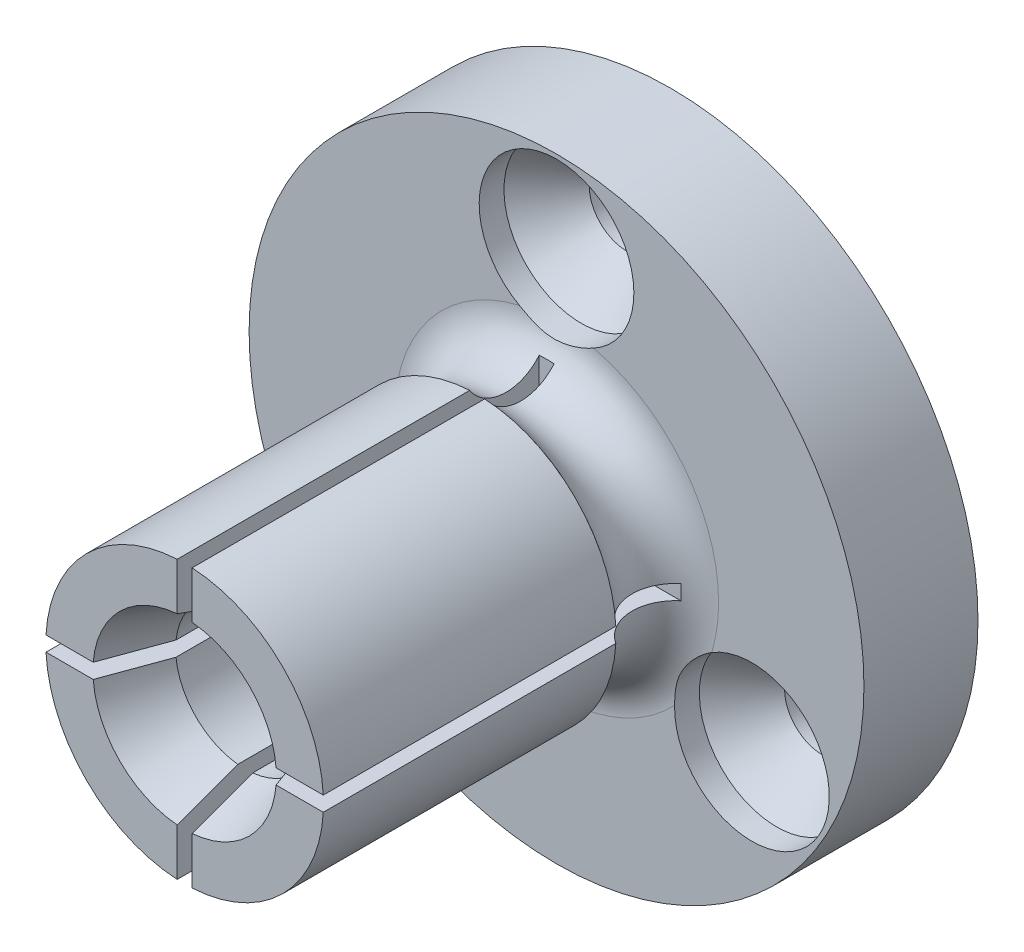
ISO-10303-21;
HEADER;
FILE_DESCRIPTION(('STEP AP214'),'2;1');
FILE_NAME('part.step','',(''),(''),'','','');
FILE_SCHEMA(('AUTOMOTIVE_DESIGN { 1 0 10303 214 1 1 1 1 }'));
ENDSEC;
DATA;
#1=APPLICATION_CONTEXT('core data for automotive mechanical design processes');
#2=APPLICATION_PROTOCOL_DEFINITION('international standard','automotive_design',2000,#1);
#3=PRODUCT_CONTEXT('',#1,'mechanical');
#4=PRODUCT('Part','Part','',(#3));
#5=PRODUCT_RELATED_PRODUCT_CATEGORY('part','',(#4));
#6=PRODUCT_DEFINITION_FORMATION('','',#4);
#7=PRODUCT_DEFINITION_CONTEXT('part definition',#1,'design');
#8=PRODUCT_DEFINITION('design','',#6,#7);
#9=PRODUCT_DEFINITION_SHAPE('','',#8);
#10=(LENGTH_UNIT() NAMED_UNIT(*) SI_UNIT(.MILLI.,.METRE.));
#11=(NAMED_UNIT(*) PLANE_ANGLE_UNIT() SI_UNIT($,.RADIAN.));
#12=(NAMED_UNIT(*) SI_UNIT($,.STERADIAN.) SOLID_ANGLE_UNIT());
#13=UNCERTAINTY_MEASURE_WITH_UNIT(LENGTH_MEASURE(1.E-05),#10,'distance_accuracy_value','');
#14=(GEOMETRIC_REPRESENTATION_CONTEXT(3) GLOBAL_UNCERTAINTY_ASSIGNED_CONTEXT((#13)) GLOBAL_UNIT_ASSIGNED_CONTEXT((#10,
#11,#12)) REPRESENTATION_CONTEXT('',''));
#15=CARTESIAN_POINT('',(0.,0.,0.));
#16=DIRECTION('',(0.,0.,1.));
#17=DIRECTION('',(1.,0.,0.));
#18=AXIS2_PLACEMENT_3D('',#15,#16,#17);
#19=CARTESIAN_POINT('',(0.,0.,0.));
#20=DIRECTION('',(0.,0.,-1.));
#21=DIRECTION('',(0.,1.,0.));
#22=AXIS2_PLACEMENT_3D('',#19,#20,#21);
#23=CYLINDRICAL_SURFACE('',#22,7.112);
#24=DIRECTION('',(0.,0.,-1.));
#25=VECTOR('',#24,1.);
#26=CARTESIAN_POINT('',(0.381000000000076,-7.10178731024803,0.));
#27=LINE('',#26,#25);
#28=CARTESIAN_POINT('',(0.381000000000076,-7.10178731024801,9.906));
#29=VERTEX_POINT('',#28);
#30=CARTESIAN_POINT('',(0.381000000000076,-7.10178731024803,24.892));
#31=VERTEX_POINT('',#30);
#32=EDGE_CURVE('E401',#29,#31,#27,.F.);
#33=ORIENTED_EDGE('',*,*,#32,.F.);
#34=CARTESIAN_POINT('',(0.,0.,9.906));
#35=DIRECTION('',(0.,0.,-1.));
#36=DIRECTION('',(0.,1.,0.));
#37=AXIS2_PLACEMENT_3D('',#34,#35,#36);
#38=CIRCLE('',#37,7.112);
#39=CARTESIAN_POINT('',(7.10178731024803,-0.381,9.906));
#40=VERTEX_POINT('',#39);
#41=EDGE_CURVE('E257',#40,#29,#38,.T.);
#42=ORIENTED_EDGE('',*,*,#41,.F.);
#43=DIRECTION('',(0.,0.,-1.));
#44=VECTOR('',#43,1.);
#45=CARTESIAN_POINT('',(7.10178731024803,-0.381,0.));
#46=LINE('',#45,#44);
#47=CARTESIAN_POINT('',(7.10178731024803,-0.381,24.892));
#48=VERTEX_POINT('',#47);
#49=EDGE_CURVE('E557',#48,#40,#46,.T.);
#50=ORIENTED_EDGE('',*,*,#49,.F.);
#51=CARTESIAN_POINT('',(0.,0.,24.892));
#52=DIRECTION('',(0.,0.,-1.));
#53=DIRECTION('',(0.,1.,0.));
#54=AXIS2_PLACEMENT_3D('',#51,#52,#53);
#55=CIRCLE('',#54,7.112);
#56=EDGE_CURVE('E508',#48,#31,#55,.T.);
#57=ORIENTED_EDGE('',*,*,#56,.T.);
#58=EDGE_LOOP('',(#33,#42,#50,#57));
#59=FACE_BOUND('',#58,.T.);
#60=ADVANCED_FACE('F14',(#59),#23,.T.);
#61=CARTESIAN_POINT('',(7.112,0.,24.892));
#62=DIRECTION('',(0.,0.,1.));
#63=DIRECTION('',(0.,-1.,0.));
#64=AXIS2_PLACEMENT_3D('',#61,#62,#63);
#65=PLANE('',#64);
#66=DIRECTION('',(0.,1.,0.));
#67=VECTOR('',#66,1.);
#68=CARTESIAN_POINT('',(0.381000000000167,-15.7433904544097,24.892));
#69=LINE('',#68,#67);
#70=CARTESIAN_POINT('',(0.381000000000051,-4.68352858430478,24.892));
#71=VERTEX_POINT('',#70);
#72=EDGE_CURVE('E765',#31,#71,#69,.T.);
#73=ORIENTED_EDGE('',*,*,#72,.F.);
#74=ORIENTED_EDGE('',*,*,#56,.F.);
#75=DIRECTION('',(1.,0.,0.));
#76=VECTOR('',#75,1.);
#77=CARTESIAN_POINT('',(15.7433904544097,-0.381,24.892));
#78=LINE('',#77,#76);
#79=CARTESIAN_POINT('',(4.68352858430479,-0.381,24.892));
#80=VERTEX_POINT('',#79);
#81=EDGE_CURVE('E575',#80,#48,#78,.T.);
#82=ORIENTED_EDGE('',*,*,#81,.F.);
#83=CARTESIAN_POINT('',(0.,0.,24.892));
#84=DIRECTION('',(0.,0.,-1.));
#85=DIRECTION('',(0.,1.,0.));
#86=AXIS2_PLACEMENT_3D('',#83,#84,#85);
#87=CIRCLE('',#86,4.699);
#88=EDGE_CURVE('E509',#80,#71,#87,.T.);
#89=ORIENTED_EDGE('',*,*,#88,.T.);
#90=EDGE_LOOP('',(#73,#74,#82,#89));
#91=FACE_BOUND('',#90,.T.);
#92=ADVANCED_FACE('F451',(#91),#65,.T.);
#93=CARTESIAN_POINT('',(0.,0.,24.892));
#94=DIRECTION('',(0.,0.,1.));
#95=DIRECTION('',(0.,-1.,0.));
#96=AXIS2_PLACEMENT_3D('',#93,#94,#95);
#97=CONICAL_SURFACE('',#96,4.699,0.349065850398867);
#98=CARTESIAN_POINT('',(0.381000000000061,-5.57223827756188,27.3269476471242));
#99=CARTESIAN_POINT('',(0.381000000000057,-5.25722497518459,26.4635917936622));
#100=CARTESIAN_POINT('',(0.381000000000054,-4.94217140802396,25.6002504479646));
#101=CARTESIAN_POINT('',(0.381000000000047,-4.31166509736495,23.8737150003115));
#102=CARTESIAN_POINT('',(0.381000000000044,-3.99621235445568,23.0105208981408));
#103=CARTESIAN_POINT('',(0.381000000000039,-3.52249382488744,21.7159259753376));
#104=CARTESIAN_POINT('',(0.381000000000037,-3.36449756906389,21.284426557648));
#105=CARTESIAN_POINT('',(0.381000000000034,-3.0482215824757,20.4215318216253));
#106=CARTESIAN_POINT('',(0.381000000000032,-2.88994185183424,19.9901365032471));
#107=CARTESIAN_POINT('',(0.381000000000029,-2.57293427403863,19.1275095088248));
#108=CARTESIAN_POINT('',(0.381000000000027,-2.41420642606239,18.6962778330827));
#109=CARTESIAN_POINT('',(0.381000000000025,-2.1755176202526,18.0496502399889));
#110=CARTESIAN_POINT('',(0.381000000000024,-2.09585512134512,17.8341442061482));
#111=CARTESIAN_POINT('',(0.381000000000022,-1.9362385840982,17.4032399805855));
#112=CARTESIAN_POINT('',(0.381000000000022,-1.85628454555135,17.1878417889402));
#113=CARTESIAN_POINT('',(0.381000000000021,-1.77613851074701,16.9725148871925));
#114=B_SPLINE_CURVE_WITH_KNOTS('',3,(#98,#99,#100,#101,#102,#103,#104,#105,#106,#107,#108,#109,
#110,#111,#112,#113),.UNSPECIFIED.,.F.,.F.,(4,2,2,2,2,2,2,4),(0.,2.75709121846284,
5.51417837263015,6.89272502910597,8.27127108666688,9.64981967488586,10.3390949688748,
11.0283707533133),.UNSPECIFIED.);
#115=CARTESIAN_POINT('',(0.38100000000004,-3.54830363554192,21.7865262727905));
#116=VERTEX_POINT('',#115);
#117=EDGE_CURVE('E726',#71,#116,#114,.T.);
#118=ORIENTED_EDGE('',*,*,#117,.F.);
#119=ORIENTED_EDGE('',*,*,#88,.F.);
#120=CARTESIAN_POINT('',(1.77613851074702,-0.381,16.9725148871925));
#121=CARTESIAN_POINT('',(1.85483400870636,-0.381,17.1839435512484));
#122=CARTESIAN_POINT('',(1.93334392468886,-0.381,17.3954411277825));
#123=CARTESIAN_POINT('',(2.09008099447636,-0.381,17.8185408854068));
#124=CARTESIAN_POINT('',(2.16830814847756,-0.381,18.0301430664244));
#125=CARTESIAN_POINT('',(2.40269798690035,-0.381,18.6650564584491));
#126=CARTESIAN_POINT('',(2.55856929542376,-0.381,19.0884751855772));
#127=CARTESIAN_POINT('',(2.87561098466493,-0.381,19.9510895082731));
#128=CARTESIAN_POINT('',(3.03676483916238,-0.381,20.3902911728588));
#129=CARTESIAN_POINT('',(3.35877692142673,-0.381,21.2688032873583));
#130=CARTESIAN_POINT('',(3.51963514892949,-0.381,21.708113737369));
#131=CARTESIAN_POINT('',(3.99621298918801,-0.381,23.0105225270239));
#132=CARTESIAN_POINT('',(4.31166631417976,-0.381,23.8737182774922));
#133=CARTESIAN_POINT('',(4.94217258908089,-0.381,25.600253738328));
#134=CARTESIAN_POINT('',(5.25722553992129,-0.381,26.4635934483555));
#135=CARTESIAN_POINT('',(5.57223827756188,-0.381,27.3269476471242));
#136=B_SPLINE_CURVE_WITH_KNOTS('',3,(#120,#121,#122,#123,#124,#125,#126,#127,#128,#129,#130,
#131,#132,#133,#134,#135),.UNSPECIFIED.,.F.,.F.,(4,2,2,2,2,2,2,4),(0.,0.676797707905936,
1.35359494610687,2.70718728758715,4.11068920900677,5.51419238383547,8.27128478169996,
11.0283707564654),.UNSPECIFIED.);
#137=CARTESIAN_POINT('',(3.54830363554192,-0.381,21.7865262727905));
#138=VERTEX_POINT('',#137);
#139=EDGE_CURVE('E344',#138,#80,#136,.T.);
#140=ORIENTED_EDGE('',*,*,#139,.F.);
#141=CARTESIAN_POINT('',(0.,0.,21.7865262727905));
#142=DIRECTION('',(0.,0.,-1.));
#143=DIRECTION('',(0.,1.,0.));
#144=AXIS2_PLACEMENT_3D('',#141,#142,#143);
#145=CIRCLE('',#144,3.5687);
#146=EDGE_CURVE('E517',#138,#116,#145,.T.);
#147=ORIENTED_EDGE('',*,*,#146,.T.);
#148=EDGE_LOOP('',(#118,#119,#140,#147));
#149=FACE_BOUND('',#148,.T.);
#150=ADVANCED_FACE('F338',(#149),#97,.F.);
#151=CARTESIAN_POINT('',(0.,0.,0.));
#152=DIRECTION('',(0.,0.,-1.));
#153=DIRECTION('',(0.,1.,0.));
#154=AXIS2_PLACEMENT_3D('',#151,#152,#153);
#155=CYLINDRICAL_SURFACE('',#154,3.5687);
#156=DIRECTION('',(0.,0.,-1.));
#157=VECTOR('',#156,1.);
#158=CARTESIAN_POINT('',(0.38100000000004,-3.54830363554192,0.));
#159=LINE('',#158,#157);
#160=CARTESIAN_POINT('',(0.38100000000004,-3.54830363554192,13.716));
#161=VERTEX_POINT('',#160);
#162=EDGE_CURVE('E759',#116,#161,#159,.T.);
#163=ORIENTED_EDGE('',*,*,#162,.F.);
#164=ORIENTED_EDGE('',*,*,#146,.F.);
#165=DIRECTION('',(0.,0.,-1.));
#166=VECTOR('',#165,1.);
#167=CARTESIAN_POINT('',(3.54830363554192,-0.381,0.));
#168=LINE('',#167,#166);
#169=CARTESIAN_POINT('',(3.54830363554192,-0.381,13.716));
#170=VERTEX_POINT('',#169);
#171=EDGE_CURVE('E592',#170,#138,#168,.F.);
#172=ORIENTED_EDGE('',*,*,#171,.F.);
#173=CARTESIAN_POINT('',(0.,0.,13.716));
#174=DIRECTION('',(0.,0.,-1.));
#175=DIRECTION('',(0.,1.,0.));
#176=AXIS2_PLACEMENT_3D('',#173,#174,#175);
#177=CIRCLE('',#176,3.5687);
#178=EDGE_CURVE('E522',#170,#161,#177,.T.);
#179=ORIENTED_EDGE('',*,*,#178,.T.);
#180=EDGE_LOOP('',(#163,#164,#172,#179));
#181=FACE_BOUND('',#180,.T.);
#182=ADVANCED_FACE('F743',(#181),#155,.F.);
#183=CARTESIAN_POINT('',(3.2639,0.,13.716));
#184=DIRECTION('',(0.,0.,1.));
#185=DIRECTION('',(0.,-1.,0.));
#186=AXIS2_PLACEMENT_3D('',#183,#184,#185);
#187=PLANE('',#186);
#188=DIRECTION('',(0.,1.,0.));
#189=VECTOR('',#188,1.);
#190=CARTESIAN_POINT('',(0.381,0.,13.716));
#191=LINE('',#190,#189);
#192=CARTESIAN_POINT('',(0.381000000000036,-3.24158637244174,13.716));
#193=VERTEX_POINT('',#192);
#194=EDGE_CURVE('E760',#161,#193,#191,.T.);
#195=ORIENTED_EDGE('',*,*,#194,.F.);
#196=ORIENTED_EDGE('',*,*,#178,.F.);
#197=DIRECTION('',(1.,0.,0.));
#198=VECTOR('',#197,1.);
#199=CARTESIAN_POINT('',(3.2639,-0.381,13.716));
#200=LINE('',#199,#198);
#201=CARTESIAN_POINT('',(3.24158637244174,-0.381,13.716));
#202=VERTEX_POINT('',#201);
#203=EDGE_CURVE('E269',#202,#170,#200,.T.);
#204=ORIENTED_EDGE('',*,*,#203,.F.);
#205=CARTESIAN_POINT('',(0.,0.,13.716));
#206=DIRECTION('',(0.,0.,-1.));
#207=DIRECTION('',(0.,1.,0.));
#208=AXIS2_PLACEMENT_3D('',#205,#206,#207);
#209=CIRCLE('',#208,3.2639);
#210=EDGE_CURVE('E527',#202,#193,#209,.T.);
#211=ORIENTED_EDGE('',*,*,#210,.T.);
#212=EDGE_LOOP('',(#195,#196,#204,#211));
#213=FACE_BOUND('',#212,.T.);
#214=ADVANCED_FACE('F463',(#213),#187,.T.);
#215=DIRECTION('',(0.,0.,-1.));
#216=VECTOR('',#215,1.);
#217=CARTESIAN_POINT('',(-0.380999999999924,-7.10178731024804,0.));
#218=LINE('',#217,#216);
#219=CARTESIAN_POINT('',(-0.380999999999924,-7.10178731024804,24.892));
#220=VERTEX_POINT('',#219);
#221=CARTESIAN_POINT('',(-0.380999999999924,-7.10178731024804,9.906));
#222=VERTEX_POINT('',#221);
#223=EDGE_CURVE('E670',#220,#222,#218,.T.);
#224=ORIENTED_EDGE('',*,*,#223,.F.);
#225=CARTESIAN_POINT('',(-7.10178731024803,-0.381000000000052,24.892));
#226=VERTEX_POINT('',#225);
#227=EDGE_CURVE('E506',#220,#226,#55,.T.);
#228=ORIENTED_EDGE('',*,*,#227,.T.);
#229=DIRECTION('',(0.,0.,-1.));
#230=VECTOR('',#229,1.);
#231=CARTESIAN_POINT('',(-7.10178731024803,-0.381000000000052,0.));
#232=LINE('',#231,#230);
#233=CARTESIAN_POINT('',(-7.10178731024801,-0.381000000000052,9.906));
#234=VERTEX_POINT('',#233);
#235=EDGE_CURVE('E326',#234,#226,#232,.F.);
#236=ORIENTED_EDGE('',*,*,#235,.F.);
#237=EDGE_CURVE('E602',#222,#234,#38,.T.);
#238=ORIENTED_EDGE('',*,*,#237,.F.);
#239=EDGE_LOOP('',(#224,#228,#236,#238));
#240=FACE_BOUND('',#239,.T.);
#241=ADVANCED_FACE('F453',(#240),#23,.T.);
#242=DIRECTION('',(0.,-1.,0.));
#243=VECTOR('',#242,1.);
#244=CARTESIAN_POINT('',(-0.380999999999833,-15.7433904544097,24.892));
#245=LINE('',#244,#243);
#246=CARTESIAN_POINT('',(-0.380999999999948,-4.68352858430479,24.892));
#247=VERTEX_POINT('',#246);
#248=EDGE_CURVE('E766',#247,#220,#245,.T.);
#249=ORIENTED_EDGE('',*,*,#248,.F.);
#250=CARTESIAN_POINT('',(-4.68352858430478,-0.381000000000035,24.892));
#251=VERTEX_POINT('',#250);
#252=EDGE_CURVE('E515',#247,#251,#87,.T.);
#253=ORIENTED_EDGE('',*,*,#252,.T.);
#254=DIRECTION('',(1.,0.,0.));
#255=VECTOR('',#254,1.);
#256=CARTESIAN_POINT('',(-15.7433904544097,-0.381000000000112,24.892));
#257=LINE('',#256,#255);
#258=EDGE_CURVE('E715',#226,#251,#257,.T.);
#259=ORIENTED_EDGE('',*,*,#258,.F.);
#260=ORIENTED_EDGE('',*,*,#227,.F.);
#261=EDGE_LOOP('',(#249,#253,#259,#260));
#262=FACE_BOUND('',#261,.T.);
#263=ADVANCED_FACE('F460',(#262),#65,.T.);
#264=CARTESIAN_POINT('',(-0.380999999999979,-1.7761385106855,16.9725148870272));
#265=CARTESIAN_POINT('',(-0.380999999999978,-1.85483400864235,17.1839435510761));
#266=CARTESIAN_POINT('',(-0.380999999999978,-1.93334392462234,17.3954411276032));
#267=CARTESIAN_POINT('',(-0.380999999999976,-2.09008099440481,17.8185408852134));
#268=CARTESIAN_POINT('',(-0.380999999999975,-2.16830814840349,18.030143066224));
#269=CARTESIAN_POINT('',(-0.380999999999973,-2.40269798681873,18.6650564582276));
#270=CARTESIAN_POINT('',(-0.380999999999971,-2.55856929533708,19.0884751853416));
#271=CARTESIAN_POINT('',(-0.380999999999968,-2.87561098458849,19.9510895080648));
#272=CARTESIAN_POINT('',(-0.380999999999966,-3.03676483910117,20.3902911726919));
#273=CARTESIAN_POINT('',(-0.380999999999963,-3.35877692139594,21.2688032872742));
#274=CARTESIAN_POINT('',(-0.380999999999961,-3.51963514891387,21.7081137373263));
#275=CARTESIAN_POINT('',(-0.380999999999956,-3.99621298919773,23.0105225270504));
#276=CARTESIAN_POINT('',(-0.380999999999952,-4.31166631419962,23.8737182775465));
#277=CARTESIAN_POINT('',(-0.380999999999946,-4.94217258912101,25.6002537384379));
#278=CARTESIAN_POINT('',(-0.380999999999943,-5.25722553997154,26.4635934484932));
#279=CARTESIAN_POINT('',(-0.380999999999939,-5.57223827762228,27.3269476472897));
#280=B_SPLINE_CURVE_WITH_KNOTS('',3,(#264,#265,#266,#267,#268,#269,#270,#271,#272,#273,#274,
#275,#276,#277,#278,#279),.UNSPECIFIED.,.F.,.F.,(4,2,2,2,2,2,2,4),(0.,0.676797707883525,
1.35359494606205,2.70718728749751,4.11068920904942,5.51419238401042,8.27128478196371,
11.0283707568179),.UNSPECIFIED.);
#281=CARTESIAN_POINT('',(-0.38099999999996,-3.54830363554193,21.7865262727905));
#282=VERTEX_POINT('',#281);
#283=EDGE_CURVE('E393',#282,#247,#280,.T.);
#284=ORIENTED_EDGE('',*,*,#283,.F.);
#285=CARTESIAN_POINT('',(-3.54830363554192,-0.381000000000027,21.7865262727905));
#286=VERTEX_POINT('',#285);
#287=EDGE_CURVE('E520',#282,#286,#145,.T.);
#288=ORIENTED_EDGE('',*,*,#287,.T.);
#289=CARTESIAN_POINT('',(-5.57223827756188,-0.381000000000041,27.3269476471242));
#290=CARTESIAN_POINT('',(-5.2572249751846,-0.381000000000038,26.4635917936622));
#291=CARTESIAN_POINT('',(-4.94217140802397,-0.381000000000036,25.6002504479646));
#292=CARTESIAN_POINT('',(-4.31166509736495,-0.381000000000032,23.8737150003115));
#293=CARTESIAN_POINT('',(-3.99621235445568,-0.38100000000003,23.0105208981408));
#294=CARTESIAN_POINT('',(-3.52249382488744,-0.381000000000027,21.7159259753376));
#295=CARTESIAN_POINT('',(-3.36449756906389,-0.381000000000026,21.284426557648));
#296=CARTESIAN_POINT('',(-3.0482215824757,-0.381000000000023,20.4215318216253));
#297=CARTESIAN_POINT('',(-2.88994185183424,-0.381000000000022,19.9901365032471));
#298=CARTESIAN_POINT('',(-2.57293427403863,-0.38100000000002,19.1275095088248));
#299=CARTESIAN_POINT('',(-2.41420642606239,-0.381000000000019,18.6962778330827));
#300=CARTESIAN_POINT('',(-2.17551762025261,-0.381000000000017,18.0496502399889));
#301=CARTESIAN_POINT('',(-2.09585512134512,-0.381000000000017,17.8341442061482));
#302=CARTESIAN_POINT('',(-1.9362385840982,-0.381000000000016,17.4032399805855));
#303=CARTESIAN_POINT('',(-1.85628454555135,-0.381000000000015,17.1878417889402));
#304=CARTESIAN_POINT('',(-1.77613851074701,-0.381000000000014,16.9725148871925));
#305=B_SPLINE_CURVE_WITH_KNOTS('',3,(#289,#290,#291,#292,#293,#294,#295,#296,#297,#298,#299,
#300,#301,#302,#303,#304),.UNSPECIFIED.,.F.,.F.,(4,2,2,2,2,2,2,4),(0.,2.75709121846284,
5.51417837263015,6.89272502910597,8.27127108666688,9.64981967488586,10.3390949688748,
11.0283707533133),.UNSPECIFIED.);
#306=EDGE_CURVE('E385',#251,#286,#305,.T.);
#307=ORIENTED_EDGE('',*,*,#306,.F.);
#308=ORIENTED_EDGE('',*,*,#252,.F.);
#309=EDGE_LOOP('',(#284,#288,#307,#308));
#310=FACE_BOUND('',#309,.T.);
#311=ADVANCED_FACE('F688',(#310),#97,.F.);
#312=DIRECTION('',(0.,0.,-1.));
#313=VECTOR('',#312,1.);
#314=CARTESIAN_POINT('',(-0.38099999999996,-3.54830363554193,0.));
#315=LINE('',#314,#313);
#316=CARTESIAN_POINT('',(-0.38099999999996,-3.54830363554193,13.716));
#317=VERTEX_POINT('',#316);
#318=EDGE_CURVE('E402',#317,#282,#315,.F.);
#319=ORIENTED_EDGE('',*,*,#318,.F.);
#320=CARTESIAN_POINT('',(-3.54830363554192,-0.381000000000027,13.716));
#321=VERTEX_POINT('',#320);
#322=EDGE_CURVE('E525',#317,#321,#177,.T.);
#323=ORIENTED_EDGE('',*,*,#322,.T.);
#324=DIRECTION('',(0.,0.,-1.));
#325=VECTOR('',#324,1.);
#326=CARTESIAN_POINT('',(-3.54830363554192,-0.381000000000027,0.));
#327=LINE('',#326,#325);
#328=EDGE_CURVE('E693',#286,#321,#327,.T.);
#329=ORIENTED_EDGE('',*,*,#328,.F.);
#330=ORIENTED_EDGE('',*,*,#287,.F.);
#331=EDGE_LOOP('',(#319,#323,#329,#330));
#332=FACE_BOUND('',#331,.T.);
#333=ADVANCED_FACE('F485',(#332),#155,.F.);
#334=DIRECTION('',(0.,-1.,0.));
#335=VECTOR('',#334,1.);
#336=CARTESIAN_POINT('',(-0.381,0.,13.716));
#337=LINE('',#336,#335);
#338=CARTESIAN_POINT('',(-0.380999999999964,-3.24158637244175,13.716));
#339=VERTEX_POINT('',#338);
#340=EDGE_CURVE('E673',#339,#317,#337,.T.);
#341=ORIENTED_EDGE('',*,*,#340,.F.);
#342=CARTESIAN_POINT('',(-3.24158637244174,-0.381000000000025,13.716));
#343=VERTEX_POINT('',#342);
#344=EDGE_CURVE('E530',#339,#343,#209,.T.);
#345=ORIENTED_EDGE('',*,*,#344,.T.);
#346=DIRECTION('',(1.,0.,0.));
#347=VECTOR('',#346,1.);
#348=CARTESIAN_POINT('',(3.2639,-0.38099999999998,13.716));
#349=LINE('',#348,#347);
#350=EDGE_CURVE('E707',#321,#343,#349,.T.);
#351=ORIENTED_EDGE('',*,*,#350,.F.);
#352=ORIENTED_EDGE('',*,*,#322,.F.);
#353=EDGE_LOOP('',(#341,#345,#351,#352));
#354=FACE_BOUND('',#353,.T.);
#355=ADVANCED_FACE('F477',(#354),#187,.T.);
#356=DIRECTION('',(0.,0.,-1.));
#357=VECTOR('',#356,1.);
#358=CARTESIAN_POINT('',(-7.10178731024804,0.380999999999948,0.));
#359=LINE('',#358,#357);
#360=CARTESIAN_POINT('',(-7.10178731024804,0.380999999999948,24.892));
#361=VERTEX_POINT('',#360);
#362=CARTESIAN_POINT('',(-7.10178731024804,0.380999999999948,9.906));
#363=VERTEX_POINT('',#362);
#364=EDGE_CURVE('E490',#361,#363,#359,.T.);
#365=ORIENTED_EDGE('',*,*,#364,.F.);
#366=CARTESIAN_POINT('',(-0.381000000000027,7.10178731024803,24.892));
#367=VERTEX_POINT('',#366);
#368=EDGE_CURVE('E493',#361,#367,#55,.T.);
#369=ORIENTED_EDGE('',*,*,#368,.T.);
#370=DIRECTION('',(0.,0.,-1.));
#371=VECTOR('',#370,1.);
#372=CARTESIAN_POINT('',(-0.381000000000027,7.10178731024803,0.));
#373=LINE('',#372,#371);
#374=CARTESIAN_POINT('',(-0.381000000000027,7.10178731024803,9.906));
#375=VERTEX_POINT('',#374);
#376=EDGE_CURVE('E609',#375,#367,#373,.F.);
#377=ORIENTED_EDGE('',*,*,#376,.F.);
#378=EDGE_CURVE('E495',#363,#375,#38,.T.);
#379=ORIENTED_EDGE('',*,*,#378,.F.);
#380=EDGE_LOOP('',(#365,#369,#377,#379));
#381=FACE_BOUND('',#380,.T.);
#382=ADVANCED_FACE('F465',(#381),#23,.T.);
#383=DIRECTION('',(-1.,0.,0.));
#384=VECTOR('',#383,1.);
#385=CARTESIAN_POINT('',(-15.7433904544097,0.380999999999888,24.892));
#386=LINE('',#385,#384);
#387=CARTESIAN_POINT('',(-4.68352858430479,0.380999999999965,24.892));
#388=VERTEX_POINT('',#387);
#389=EDGE_CURVE('E502',#388,#361,#386,.T.);
#390=ORIENTED_EDGE('',*,*,#389,.F.);
#391=CARTESIAN_POINT('',(-0.381000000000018,4.68352858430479,24.892));
#392=VERTEX_POINT('',#391);
#393=EDGE_CURVE('E734',#388,#392,#87,.T.);
#394=ORIENTED_EDGE('',*,*,#393,.T.);
#395=DIRECTION('',(0.,-1.,0.));
#396=VECTOR('',#395,1.);
#397=CARTESIAN_POINT('',(-0.381000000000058,15.7433904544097,24.892));
#398=LINE('',#397,#396);
#399=EDGE_CURVE('E505',#367,#392,#398,.T.);
#400=ORIENTED_EDGE('',*,*,#399,.F.);
#401=ORIENTED_EDGE('',*,*,#368,.F.);
#402=EDGE_LOOP('',(#390,#394,#400,#401));
#403=FACE_BOUND('',#402,.T.);
#404=ADVANCED_FACE('F474',(#403),#65,.T.);
#405=CARTESIAN_POINT('',(-1.7761385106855,0.380999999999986,16.9725148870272));
#406=CARTESIAN_POINT('',(-1.85483400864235,0.380999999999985,17.1839435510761));
#407=CARTESIAN_POINT('',(-1.93334392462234,0.380999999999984,17.3954411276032));
#408=CARTESIAN_POINT('',(-2.09008099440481,0.380999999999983,17.8185408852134));
#409=CARTESIAN_POINT('',(-2.16830814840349,0.380999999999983,18.030143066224));
#410=CARTESIAN_POINT('',(-2.40269798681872,0.380999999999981,18.6650564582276));
#411=CARTESIAN_POINT('',(-2.55856929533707,0.38099999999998,19.0884751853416));
#412=CARTESIAN_POINT('',(-2.87561098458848,0.380999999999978,19.9510895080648));
#413=CARTESIAN_POINT('',(-3.03676483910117,0.380999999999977,20.3902911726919));
#414=CARTESIAN_POINT('',(-3.35877692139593,0.380999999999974,21.2688032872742));
#415=CARTESIAN_POINT('',(-3.51963514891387,0.380999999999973,21.7081137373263));
#416=CARTESIAN_POINT('',(-3.99621298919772,0.38099999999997,23.0105225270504));
#417=CARTESIAN_POINT('',(-4.31166631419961,0.380999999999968,23.8737182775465));
#418=CARTESIAN_POINT('',(-4.94217258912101,0.380999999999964,25.6002537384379));
#419=CARTESIAN_POINT('',(-5.25722553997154,0.380999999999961,26.4635934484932));
#420=CARTESIAN_POINT('',(-5.57223827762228,0.380999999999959,27.3269476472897));
#421=B_SPLINE_CURVE_WITH_KNOTS('',3,(#405,#406,#407,#408,#409,#410,#411,#412,#413,#414,#415,
#416,#417,#418,#419,#420),.UNSPECIFIED.,.F.,.F.,(4,2,2,2,2,2,2,4),(0.,0.676797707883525,
1.35359494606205,2.7071872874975,4.11068920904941,5.51419238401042,8.2712847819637,
11.0283707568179),.UNSPECIFIED.);
#422=CARTESIAN_POINT('',(-3.54830363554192,0.380999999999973,21.7865262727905));
#423=VERTEX_POINT('',#422);
#424=EDGE_CURVE('E318',#423,#388,#421,.T.);
#425=ORIENTED_EDGE('',*,*,#424,.F.);
#426=CARTESIAN_POINT('',(-0.381000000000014,3.54830363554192,21.7865262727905));
#427=VERTEX_POINT('',#426);
#428=EDGE_CURVE('E694',#423,#427,#145,.T.);
#429=ORIENTED_EDGE('',*,*,#428,.T.);
#430=CARTESIAN_POINT('',(-0.381000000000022,5.57223827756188,27.3269476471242));
#431=CARTESIAN_POINT('',(-0.381000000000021,5.2572249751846,26.4635917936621));
#432=CARTESIAN_POINT('',(-0.38100000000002,4.94217140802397,25.6002504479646));
#433=CARTESIAN_POINT('',(-0.381000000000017,4.31166509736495,23.8737150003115));
#434=CARTESIAN_POINT('',(-0.381000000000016,3.99621235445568,23.0105208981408));
#435=CARTESIAN_POINT('',(-0.381000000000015,3.52249382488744,21.7159259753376));
#436=CARTESIAN_POINT('',(-0.381000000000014,3.36449756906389,21.284426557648));
#437=CARTESIAN_POINT('',(-0.381000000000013,3.0482215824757,20.4215318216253));
#438=CARTESIAN_POINT('',(-0.381000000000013,2.88994185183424,19.9901365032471));
#439=CARTESIAN_POINT('',(-0.381000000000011,2.57293427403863,19.1275095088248));
#440=CARTESIAN_POINT('',(-0.381000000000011,2.41420642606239,18.6962778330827));
#441=CARTESIAN_POINT('',(-0.38100000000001,2.17551762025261,18.0496502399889));
#442=CARTESIAN_POINT('',(-0.38100000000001,2.09585512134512,17.8341442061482));
#443=CARTESIAN_POINT('',(-0.381000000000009,1.9362385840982,17.4032399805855));
#444=CARTESIAN_POINT('',(-0.381000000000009,1.85628454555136,17.1878417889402));
#445=CARTESIAN_POINT('',(-0.381000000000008,1.77613851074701,16.9725148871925));
#446=B_SPLINE_CURVE_WITH_KNOTS('',3,(#430,#431,#432,#433,#434,#435,#436,#437,#438,#439,#440,
#441,#442,#443,#444,#445),.UNSPECIFIED.,.F.,.F.,(4,2,2,2,2,2,2,4),(0.,2.75709121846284,
5.51417837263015,6.89272502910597,8.27127108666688,9.64981967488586,10.3390949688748,
11.0283707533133),.UNSPECIFIED.);
#447=EDGE_CURVE('E376',#392,#427,#446,.T.);
#448=ORIENTED_EDGE('',*,*,#447,.F.);
#449=ORIENTED_EDGE('',*,*,#393,.F.);
#450=EDGE_LOOP('',(#425,#429,#448,#449));
#451=FACE_BOUND('',#450,.T.);
#452=ADVANCED_FACE('F339',(#451),#97,.F.);
#453=DIRECTION('',(0.,0.,-1.));
#454=VECTOR('',#453,1.);
#455=CARTESIAN_POINT('',(-3.54830363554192,0.380999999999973,0.));
#456=LINE('',#455,#454);
#457=CARTESIAN_POINT('',(-3.54830363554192,0.380999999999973,13.716));
#458=VERTEX_POINT('',#457);
#459=EDGE_CURVE('E327',#458,#423,#456,.F.);
#460=ORIENTED_EDGE('',*,*,#459,.F.);
#461=CARTESIAN_POINT('',(-0.381000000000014,3.54830363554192,13.716));
#462=VERTEX_POINT('',#461);
#463=EDGE_CURVE('E641',#458,#462,#177,.T.);
#464=ORIENTED_EDGE('',*,*,#463,.T.);
#465=DIRECTION('',(0.,0.,-1.));
#466=VECTOR('',#465,1.);
#467=CARTESIAN_POINT('',(-0.381000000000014,3.54830363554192,0.));
#468=LINE('',#467,#466);
#469=EDGE_CURVE('E613',#427,#462,#468,.T.);
#470=ORIENTED_EDGE('',*,*,#469,.F.);
#471=ORIENTED_EDGE('',*,*,#428,.F.);
#472=EDGE_LOOP('',(#460,#464,#470,#471));
#473=FACE_BOUND('',#472,.T.);
#474=ADVANCED_FACE('F735',(#473),#155,.F.);
#475=DIRECTION('',(-1.,0.,0.));
#476=VECTOR('',#475,1.);
#477=CARTESIAN_POINT('',(3.2639,0.38100000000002,13.716));
#478=LINE('',#477,#476);
#479=CARTESIAN_POINT('',(-3.24158637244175,0.380999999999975,13.716));
#480=VERTEX_POINT('',#479);
#481=EDGE_CURVE('E497',#480,#458,#478,.T.);
#482=ORIENTED_EDGE('',*,*,#481,.F.);
#483=CARTESIAN_POINT('',(-0.381000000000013,3.24158637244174,13.716));
#484=VERTEX_POINT('',#483);
#485=EDGE_CURVE('E643',#480,#484,#209,.T.);
#486=ORIENTED_EDGE('',*,*,#485,.T.);
#487=DIRECTION('',(0.,-1.,0.));
#488=VECTOR('',#487,1.);
#489=CARTESIAN_POINT('',(-0.381,0.,13.716));
#490=LINE('',#489,#488);
#491=EDGE_CURVE('E279',#462,#484,#490,.T.);
#492=ORIENTED_EDGE('',*,*,#491,.F.);
#493=ORIENTED_EDGE('',*,*,#463,.F.);
#494=EDGE_LOOP('',(#482,#486,#492,#493));
#495=FACE_BOUND('',#494,.T.);
#496=ADVANCED_FACE('F487',(#495),#187,.T.);
#497=CARTESIAN_POINT('',(0.,0.,0.));
#498=DIRECTION('',(0.,0.,-1.));
#499=DIRECTION('',(0.,1.,0.));
#500=AXIS2_PLACEMENT_3D('',#497,#498,#499);
#501=CYLINDRICAL_SURFACE('',#500,3.2639);
#502=DIRECTION('',(0.,0.,1.));
#503=VECTOR('',#502,1.);
#504=CARTESIAN_POINT('',(0.381000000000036,-3.24158637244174,6.35));
#505=LINE('',#504,#503);
#506=CARTESIAN_POINT('',(0.381000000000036,-3.24158637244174,6.35));
#507=VERTEX_POINT('',#506);
#508=EDGE_CURVE('E664',#507,#193,#505,.T.);
#509=ORIENTED_EDGE('',*,*,#508,.T.);
#510=ORIENTED_EDGE('',*,*,#210,.F.);
#511=DIRECTION('',(0.,0.,1.));
#512=VECTOR('',#511,1.);
#513=CARTESIAN_POINT('',(3.24158637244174,-0.381,6.35));
#514=LINE('',#513,#512);
#515=CARTESIAN_POINT('',(3.24158637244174,-0.381,6.35));
#516=VERTEX_POINT('',#515);
#517=EDGE_CURVE('E588',#516,#202,#514,.T.);
#518=ORIENTED_EDGE('',*,*,#517,.F.);
#519=CARTESIAN_POINT('',(0.,0.,6.35));
#520=DIRECTION('',(0.,0.,-1.));
#521=DIRECTION('',(0.,-1.,0.));
#522=AXIS2_PLACEMENT_3D('',#519,#520,#521);
#523=CIRCLE('',#522,3.2639);
#524=CARTESIAN_POINT('',(3.24158637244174,0.381,6.35));
#525=VERTEX_POINT('',#524);
#526=EDGE_CURVE('E574',#525,#516,#523,.T.);
#527=ORIENTED_EDGE('',*,*,#526,.F.);
#528=DIRECTION('',(0.,0.,1.));
#529=VECTOR('',#528,1.);
#530=CARTESIAN_POINT('',(3.24158637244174,0.381,6.35));
#531=LINE('',#530,#529);
#532=CARTESIAN_POINT('',(3.24158637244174,0.381,13.716));
#533=VERTEX_POINT('',#532);
#534=EDGE_CURVE('E589',#525,#533,#531,.T.);
#535=ORIENTED_EDGE('',*,*,#534,.T.);
#536=CARTESIAN_POINT('',(0.380999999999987,3.24158637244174,13.716));
#537=VERTEX_POINT('',#536);
#538=EDGE_CURVE('E531',#537,#533,#209,.T.);
#539=ORIENTED_EDGE('',*,*,#538,.F.);
#540=DIRECTION('',(0.,0.,1.));
#541=VECTOR('',#540,1.);
#542=CARTESIAN_POINT('',(0.380999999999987,3.24158637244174,6.35));
#543=LINE('',#542,#541);
#544=CARTESIAN_POINT('',(0.380999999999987,3.24158637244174,6.35));
#545=VERTEX_POINT('',#544);
#546=EDGE_CURVE('E1142',#545,#537,#543,.T.);
#547=ORIENTED_EDGE('',*,*,#546,.F.);
#548=CARTESIAN_POINT('',(0.,0.,6.35));
#549=DIRECTION('',(0.,0.,-1.));
#550=DIRECTION('',(1.,0.,0.));
#551=AXIS2_PLACEMENT_3D('',#548,#549,#550);
#552=CIRCLE('',#551,3.2639);
#553=CARTESIAN_POINT('',(-0.381000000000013,3.24158637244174,6.35));
#554=VERTEX_POINT('',#553);
#555=EDGE_CURVE('E1141',#554,#545,#552,.T.);
#556=ORIENTED_EDGE('',*,*,#555,.F.);
#557=DIRECTION('',(0.,0.,1.));
#558=VECTOR('',#557,1.);
#559=CARTESIAN_POINT('',(-0.381000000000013,3.24158637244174,6.35));
#560=LINE('',#559,#558);
#561=EDGE_CURVE('E1145',#554,#484,#560,.T.);
#562=ORIENTED_EDGE('',*,*,#561,.T.);
#563=ORIENTED_EDGE('',*,*,#485,.F.);
#564=DIRECTION('',(0.,0.,1.));
#565=VECTOR('',#564,1.);
#566=CARTESIAN_POINT('',(-3.24158637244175,0.380999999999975,6.35));
#567=LINE('',#566,#565);
#568=CARTESIAN_POINT('',(-3.24158637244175,0.380999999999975,6.35));
#569=VERTEX_POINT('',#568);
#570=EDGE_CURVE('E732',#569,#480,#567,.T.);
#571=ORIENTED_EDGE('',*,*,#570,.F.);
#572=CARTESIAN_POINT('',(0.,0.,6.35));
#573=DIRECTION('',(0.,0.,-1.));
#574=DIRECTION('',(0.,1.,0.));
#575=AXIS2_PLACEMENT_3D('',#572,#573,#574);
#576=CIRCLE('',#575,3.2639);
#577=CARTESIAN_POINT('',(-3.24158637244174,-0.381000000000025,6.35));
#578=VERTEX_POINT('',#577);
#579=EDGE_CURVE('E721',#578,#569,#576,.T.);
#580=ORIENTED_EDGE('',*,*,#579,.F.);
#581=DIRECTION('',(0.,0.,1.));
#582=VECTOR('',#581,1.);
#583=CARTESIAN_POINT('',(-3.24158637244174,-0.381000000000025,6.35));
#584=LINE('',#583,#582);
#585=EDGE_CURVE('E498',#578,#343,#584,.T.);
#586=ORIENTED_EDGE('',*,*,#585,.T.);
#587=ORIENTED_EDGE('',*,*,#344,.F.);
#588=DIRECTION('',(0.,0.,1.));
#589=VECTOR('',#588,1.);
#590=CARTESIAN_POINT('',(-0.380999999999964,-3.24158637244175,6.35));
#591=LINE('',#590,#589);
#592=CARTESIAN_POINT('',(-0.380999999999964,-3.24158637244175,6.35));
#593=VERTEX_POINT('',#592);
#594=EDGE_CURVE('E671',#593,#339,#591,.T.);
#595=ORIENTED_EDGE('',*,*,#594,.F.);
#596=CARTESIAN_POINT('',(0.,0.,6.35));
#597=DIRECTION('',(0.,0.,-1.));
#598=DIRECTION('',(-1.,0.,0.));
#599=AXIS2_PLACEMENT_3D('',#596,#597,#598);
#600=CIRCLE('',#599,3.2639);
#601=EDGE_CURVE('E667',#507,#593,#600,.T.);
#602=ORIENTED_EDGE('',*,*,#601,.F.);
#603=EDGE_LOOP('',(#509,#510,#518,#527,#535,#539,#547,#556,#562,#563,#571,#580,#586,#587,#595,#602));
#604=FACE_BOUND('',#603,.T.);
#605=CARTESIAN_POINT('',(0.,0.,0.));
#606=DIRECTION('',(0.,0.,-1.));
#607=DIRECTION('',(0.,1.,0.));
#608=AXIS2_PLACEMENT_3D('',#605,#606,#607);
#609=CIRCLE('',#608,3.2639);
#610=CARTESIAN_POINT('',(0.,3.2639,0.));
#611=VERTEX_POINT('',#610);
#612=EDGE_CURVE('E266',#611,#611,#609,.T.);
#613=ORIENTED_EDGE('',*,*,#612,.T.);
#614=EDGE_LOOP('',(#613));
#615=FACE_BOUND('',#614,.T.);
#616=ADVANCED_FACE('F16',(#604,#615),#501,.F.);
#617=CARTESIAN_POINT('',(3.2639,0.,0.));
#618=DIRECTION('',(0.,0.,-1.));
#619=DIRECTION('',(0.,1.,0.));
#620=AXIS2_PLACEMENT_3D('',#617,#618,#619);
#621=PLANE('',#620);
#622=CARTESIAN_POINT('',(10.0086555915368,-5.77849999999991,0.));
#623=DIRECTION('',(0.,0.,-1.));
#624=DIRECTION('',(0.,1.,0.));
#625=AXIS2_PLACEMENT_3D('',#622,#623,#624);
#626=CIRCLE('',#625,1.9304);
#627=CARTESIAN_POINT('',(10.0086555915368,-3.84809999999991,0.));
#628=VERTEX_POINT('',#627);
#629=EDGE_CURVE('E18',#628,#628,#626,.T.);
#630=ORIENTED_EDGE('',*,*,#629,.F.);
#631=EDGE_LOOP('',(#630));
#632=FACE_BOUND('',#631,.T.);
#633=CARTESIAN_POINT('',(-10.0086555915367,-5.7785,0.));
#634=DIRECTION('',(0.,0.,-1.));
#635=DIRECTION('',(0.,1.,0.));
#636=AXIS2_PLACEMENT_3D('',#633,#634,#635);
#637=CIRCLE('',#636,1.9304);
#638=CARTESIAN_POINT('',(-10.0086555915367,-3.8481,0.));
#639=VERTEX_POINT('',#638);
#640=EDGE_CURVE('E1080',#639,#639,#637,.T.);
#641=ORIENTED_EDGE('',*,*,#640,.F.);
#642=EDGE_LOOP('',(#641));
#643=FACE_BOUND('',#642,.T.);
#644=CARTESIAN_POINT('',(0.,11.557,0.));
#645=DIRECTION('',(0.,0.,-1.));
#646=DIRECTION('',(0.,1.,0.));
#647=AXIS2_PLACEMENT_3D('',#644,#645,#646);
#648=CIRCLE('',#647,1.9304);
#649=CARTESIAN_POINT('',(0.,13.4874,0.));
#650=VERTEX_POINT('',#649);
#651=EDGE_CURVE('E435',#650,#650,#648,.T.);
#652=ORIENTED_EDGE('',*,*,#651,.F.);
#653=EDGE_LOOP('',(#652));
#654=FACE_BOUND('',#653,.T.);
#655=CARTESIAN_POINT('',(0.,0.,0.));
#656=DIRECTION('',(0.,0.,-1.));
#657=DIRECTION('',(0.,1.,0.));
#658=AXIS2_PLACEMENT_3D('',#655,#656,#657);
#659=CIRCLE('',#658,15.748);
#660=CARTESIAN_POINT('',(0.,15.748,0.));
#661=VERTEX_POINT('',#660);
#662=EDGE_CURVE('E263',#661,#661,#659,.T.);
#663=ORIENTED_EDGE('',*,*,#662,.T.);
#664=EDGE_LOOP('',(#663));
#665=FACE_BOUND('',#664,.T.);
#666=ORIENTED_EDGE('',*,*,#612,.F.);
#667=EDGE_LOOP('',(#666));
#668=FACE_BOUND('',#667,.T.);
#669=ADVANCED_FACE('F982',(#632,#643,#654,#665,#668),#621,.T.);
#670=CARTESIAN_POINT('',(0.,0.,0.));
#671=DIRECTION('',(0.,0.,-1.));
#672=DIRECTION('',(0.,1.,0.));
#673=AXIS2_PLACEMENT_3D('',#670,#671,#672);
#674=CYLINDRICAL_SURFACE('',#673,15.748);
#675=CARTESIAN_POINT('',(0.,0.,5.842));
#676=DIRECTION('',(0.,0.,-1.));
#677=DIRECTION('',(0.,1.,0.));
#678=AXIS2_PLACEMENT_3D('',#675,#676,#677);
#679=CIRCLE('',#678,15.748);
#680=CARTESIAN_POINT('',(0.,15.748,5.842));
#681=VERTEX_POINT('',#680);
#682=EDGE_CURVE('E256',#681,#681,#679,.T.);
#683=ORIENTED_EDGE('',*,*,#682,.T.);
#684=EDGE_LOOP('',(#683));
#685=FACE_BOUND('',#684,.T.);
#686=ORIENTED_EDGE('',*,*,#662,.F.);
#687=EDGE_LOOP('',(#686));
#688=FACE_BOUND('',#687,.T.);
#689=ADVANCED_FACE('F974',(#685,#688),#674,.T.);
#690=CARTESIAN_POINT('',(15.748,0.,5.842));
#691=DIRECTION('',(0.,0.,1.));
#692=DIRECTION('',(0.,-1.,0.));
#693=AXIS2_PLACEMENT_3D('',#690,#691,#692);
#694=PLANE('',#693);
#695=CARTESIAN_POINT('',(10.0086555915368,-5.77849999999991,5.842));
#696=DIRECTION('',(0.,0.,1.));
#697=DIRECTION('',(0.,-1.,0.));
#698=AXIS2_PLACEMENT_3D('',#695,#696,#697);
#699=CIRCLE('',#698,3.9624);
#700=CARTESIAN_POINT('',(6.04727806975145,-5.68848950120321,5.842));
#701=VERTEX_POINT('',#700);
#702=CARTESIAN_POINT('',(7.95001545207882,-2.39285168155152,5.842));
#703=VERTEX_POINT('',#702);
#704=EDGE_CURVE('E28',#701,#703,#699,.T.);
#705=ORIENTED_EDGE('',*,*,#704,.F.);
#706=CARTESIAN_POINT('',(0.,0.,5.842));
#707=DIRECTION('',(0.,0.,-1.));
#708=DIRECTION('',(0.,1.,0.));
#709=AXIS2_PLACEMENT_3D('',#706,#707,#708);
#710=CIRCLE('',#709,8.30231804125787);
#711=CARTESIAN_POINT('',(-6.04727806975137,-5.68848950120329,5.842));
#712=VERTEX_POINT('',#711);
#713=EDGE_CURVE('E35',#701,#712,#710,.T.);
#714=ORIENTED_EDGE('',*,*,#713,.T.);
#715=CARTESIAN_POINT('',(-10.0086555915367,-5.7785,5.842));
#716=DIRECTION('',(0.,0.,1.));
#717=DIRECTION('',(0.,-1.,0.));
#718=AXIS2_PLACEMENT_3D('',#715,#716,#717);
#719=CIRCLE('',#718,3.9624);
#720=CARTESIAN_POINT('',(-7.95001545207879,-2.39285168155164,5.842));
#721=VERTEX_POINT('',#720);
#722=EDGE_CURVE('E1085',#721,#712,#719,.T.);
#723=ORIENTED_EDGE('',*,*,#722,.F.);
#724=CARTESIAN_POINT('',(-1.9027373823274,8.08134118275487,5.842));
#725=VERTEX_POINT('',#724);
#726=EDGE_CURVE('E254',#721,#725,#710,.T.);
#727=ORIENTED_EDGE('',*,*,#726,.T.);
#728=CARTESIAN_POINT('',(0.,11.557,5.842));
#729=DIRECTION('',(0.,0.,1.));
#730=DIRECTION('',(0.,-1.,0.));
#731=AXIS2_PLACEMENT_3D('',#728,#729,#730);
#732=CIRCLE('',#731,3.9624);
#733=CARTESIAN_POINT('',(1.9027373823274,8.08134118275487,5.842));
#734=VERTEX_POINT('',#733);
#735=EDGE_CURVE('E1082',#734,#725,#732,.T.);
#736=ORIENTED_EDGE('',*,*,#735,.F.);
#737=EDGE_CURVE('E247',#734,#703,#710,.T.);
#738=ORIENTED_EDGE('',*,*,#737,.T.);
#739=EDGE_LOOP('',(#705,#714,#723,#727,#736,#738));
#740=FACE_BOUND('',#739,.T.);
#741=ORIENTED_EDGE('',*,*,#682,.F.);
#742=EDGE_LOOP('',(#741));
#743=FACE_BOUND('',#742,.T.);
#744=ADVANCED_FACE('F244',(#740,#743),#694,.T.);
#745=CARTESIAN_POINT('',(0.,0.,8.04831804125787));
#746=DIRECTION('',(0.,0.,-1.));
#747=DIRECTION('',(0.,1.,0.));
#748=AXIS2_PLACEMENT_3D('',#745,#746,#747);
#749=TOROIDAL_SURFACE('',#748,8.30231804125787,2.20631804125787);
#750=CARTESIAN_POINT('',(8.30251804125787,-2.20222981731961,5.86078628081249));
#751=CARTESIAN_POINT('',(8.21786856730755,-2.24258593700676,5.85139263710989));
#752=CARTESIAN_POINT('',(8.13443704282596,-2.28610343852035,5.8459180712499));
#753=CARTESIAN_POINT('',(7.97092163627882,-2.37893871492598,5.8410842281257));
#754=CARTESIAN_POINT('',(7.89083027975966,-2.42824248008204,5.84171046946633));
#755=CARTESIAN_POINT('',(7.73457602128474,-2.53227159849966,5.84732441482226));
#756=CARTESIAN_POINT('',(7.65840929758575,-2.586991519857,5.85230778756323));
#757=CARTESIAN_POINT('',(7.51024077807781,-2.70160034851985,5.86491739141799));
#758=CARTESIAN_POINT('',(7.43824160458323,-2.76149245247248,5.87254526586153));
#759=CARTESIAN_POINT('',(7.30008357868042,-2.88494369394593,5.88863979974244));
#760=CARTESIAN_POINT('',(7.23383845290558,-2.94840901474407,5.89708729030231));
#761=CARTESIAN_POINT('',(7.10589152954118,-3.07980027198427,5.91349724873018));
#762=CARTESIAN_POINT('',(7.04418873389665,-3.14772522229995,5.92145982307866));
#763=CARTESIAN_POINT('',(6.92567494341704,-3.28767017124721,5.93562756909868));
#764=CARTESIAN_POINT('',(6.8688546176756,-3.35968190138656,5.9418361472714));
#765=CARTESIAN_POINT('',(6.7602636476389,-3.50760101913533,5.95155598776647));
#766=CARTESIAN_POINT('',(6.70849325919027,-3.58350860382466,5.95506711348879));
#767=CARTESIAN_POINT('',(6.60156078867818,-3.75265934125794,5.95916540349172));
#768=CARTESIAN_POINT('',(6.5474398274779,-3.84658023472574,5.95911959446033));
#769=CARTESIAN_POINT('',(6.4471118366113,-4.03845792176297,5.95449918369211));
#770=CARTESIAN_POINT('',(6.4009061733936,-4.13641540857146,5.94992380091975));
#771=CARTESIAN_POINT('',(6.31655104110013,-4.3360121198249,5.9372072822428));
#772=CARTESIAN_POINT('',(6.27843809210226,-4.43766570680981,5.92905047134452));
#773=CARTESIAN_POINT('',(6.2107123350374,-4.64360194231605,5.91093168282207));
#774=CARTESIAN_POINT('',(6.18109991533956,-4.74788471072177,5.90096962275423));
#775=CARTESIAN_POINT('',(6.13117519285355,-4.95577172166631,5.8817417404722));
#776=CARTESIAN_POINT('',(6.11063719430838,-5.0593206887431,5.87246446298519));
#777=CARTESIAN_POINT('',(6.07786371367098,-5.26797011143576,5.85663420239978));
#778=CARTESIAN_POINT('',(6.06562968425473,-5.37307083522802,5.85008169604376));
#779=CARTESIAN_POINT('',(6.04965147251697,-5.58361517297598,5.84217014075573));
#780=CARTESIAN_POINT('',(6.04586442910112,-5.68905432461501,5.84078484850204));
#781=CARTESIAN_POINT('',(6.04671024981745,-5.89966932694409,5.84557716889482));
#782=CARTESIAN_POINT('',(6.05133501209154,-6.00484533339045,5.85174750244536));
#783=CARTESIAN_POINT('',(6.07031634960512,-6.23135800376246,5.87588541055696));
#784=CARTESIAN_POINT('',(6.08619691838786,-6.35239458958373,5.89568404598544));
#785=CARTESIAN_POINT('',(6.12812773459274,-6.58875000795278,5.95191343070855));
#786=CARTESIAN_POINT('',(6.15417210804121,-6.70407209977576,5.98833457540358));
#787=CARTESIAN_POINT('',(6.2142232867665,-6.92573823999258,6.07970784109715));
#788=CARTESIAN_POINT('',(6.24827179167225,-7.0320311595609,6.13475769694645));
#789=CARTESIAN_POINT('',(6.32068713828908,-7.23135088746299,6.26320590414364));
#790=CARTESIAN_POINT('',(6.35905644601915,-7.32437005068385,6.33661476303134));
#791=CARTESIAN_POINT('',(6.42766257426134,-7.47629685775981,6.48238014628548));
#792=CARTESIAN_POINT('',(6.45788396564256,-7.53824540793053,6.5516050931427));
#793=CARTESIAN_POINT('',(6.50174858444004,-7.62328571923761,6.66195706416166));
#794=CARTESIAN_POINT('',(6.51612274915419,-7.65031400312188,6.6998183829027));
#795=CARTESIAN_POINT('',(6.54416874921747,-7.70172646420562,6.77754743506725));
#796=CARTESIAN_POINT('',(6.55784054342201,-7.72611048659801,6.81741528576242));
#797=CARTESIAN_POINT('',(6.5710525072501,-7.74915948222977,6.8582));
#798=B_SPLINE_CURVE_WITH_KNOTS('',3,(#750,#751,#752,#753,#754,#755,#756,#757,#758,#759,#760,
#761,#762,#763,#764,#765,#766,#767,#768,#769,#770,#771,#772,#773,#774,#775,#776,#777,#778,#779,
#780,#781,#782,#783,#784,#785,#786,#787,#788,#789,#790,#791,#792,#793,#794,#795,#796,#797),
.UNSPECIFIED.,.F.,.F.,(4,2,2,2,2,2,2,2,2,2,2,2,2,2,2,2,2,2,2,2,2,2,2,4),(0.,0.282412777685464,
0.564155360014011,0.845618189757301,1.12725623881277,1.40342415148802,1.67953120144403,
1.95509826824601,2.23067928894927,2.55539701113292,2.88017073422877,3.20638030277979,
3.53260477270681,3.85018269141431,4.16781615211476,4.48383419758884,4.79954803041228,
5.16905864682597,5.53835602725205,5.90962175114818,6.28110045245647,6.57314457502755,
6.71910679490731,6.8650775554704),.UNSPECIFIED.);
#799=EDGE_CURVE('E9',#703,#701,#798,.T.);
#800=ORIENTED_EDGE('',*,*,#799,.F.);
#801=ORIENTED_EDGE('',*,*,#737,.F.);
#802=CARTESIAN_POINT('',(-2.26030107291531,8.30251804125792,5.86281860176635));
#803=CARTESIAN_POINT('',(-2.18329219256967,8.24900191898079,5.85286817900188));
#804=CARTESIAN_POINT('',(-2.10411740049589,8.19809692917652,5.84689958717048));
#805=CARTESIAN_POINT('',(-1.94236451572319,8.10206131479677,5.84120486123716));
#806=CARTESIAN_POINT('',(-1.85979518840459,8.05691691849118,5.84146354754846));
#807=CARTESIAN_POINT('',(-1.6919098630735,7.97274498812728,5.84646722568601));
#808=CARTESIAN_POINT('',(-1.60659762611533,7.93370947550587,5.85120630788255));
#809=CARTESIAN_POINT('',(-1.43354873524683,7.86182312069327,5.8634449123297));
#810=CARTESIAN_POINT('',(-1.34581057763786,7.82897621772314,5.87094618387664));
#811=CARTESIAN_POINT('',(-1.17078419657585,7.77042383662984,5.88683332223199));
#812=CARTESIAN_POINT('',(-1.08355062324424,7.74454599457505,5.89518899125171));
#813=CARTESIAN_POINT('',(-0.907495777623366,7.69884847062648,5.91152919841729));
#814=CARTESIAN_POINT('',(-0.81867487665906,7.67902739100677,5.91951382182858));
#815=CARTESIAN_POINT('',(-0.639918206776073,7.64555919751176,5.93385219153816));
#816=CARTESIAN_POINT('',(-0.549984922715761,7.63190023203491,5.9402090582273));
#817=CARTESIAN_POINT('',(-0.369237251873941,7.61079202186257,5.95034459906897));
#818=CARTESIAN_POINT('',(-0.278422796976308,7.60334326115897,5.9541230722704));
#819=CARTESIAN_POINT('',(-0.0788949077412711,7.59389704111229,5.95892871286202));
#820=CARTESIAN_POINT('',(0.0299015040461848,7.59322367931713,5.95928689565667));
#821=CARTESIAN_POINT('',(0.247098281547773,7.6008188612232,5.95539994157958));
#822=CARTESIAN_POINT('',(0.355498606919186,7.60908829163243,5.9511543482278));
#823=CARTESIAN_POINT('',(0.571395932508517,7.63450373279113,5.93896754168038));
#824=CARTESIAN_POINT('',(0.678888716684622,7.65167924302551,5.93101405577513));
#825=CARTESIAN_POINT('',(0.891964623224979,7.69476806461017,5.91313247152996));
#826=CARTESIAN_POINT('',(0.997547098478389,7.72068428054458,5.90320371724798));
#827=CARTESIAN_POINT('',(1.20489774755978,7.78071473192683,5.88373471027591));
#828=CARTESIAN_POINT('',(1.30669763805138,7.81471822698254,5.8741910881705));
#829=CARTESIAN_POINT('',(1.50731679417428,7.89092312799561,5.85778010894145));
#830=CARTESIAN_POINT('',(1.60613863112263,7.93311721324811,5.85091037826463));
#831=CARTESIAN_POINT('',(1.80010137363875,8.02546636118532,5.84240564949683));
#832=CARTESIAN_POINT('',(1.89524800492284,8.07560836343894,5.84076215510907));
#833=CARTESIAN_POINT('',(2.08130725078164,8.1835054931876,5.84526369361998));
#834=CARTESIAN_POINT('',(2.1722050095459,8.24128496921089,5.85143420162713));
#835=CARTESIAN_POINT('',(2.26030107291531,8.30251804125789,5.86281860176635));
#836=B_SPLINE_CURVE_WITH_KNOTS('',3,(#802,#803,#804,#805,#806,#807,#808,#809,#810,#811,#812,
#813,#814,#815,#816,#817,#818,#819,#820,#821,#822,#823,#824,#825,#826,#827,#828,#829,#830,#831,
#832,#833,#834,#835),.UNSPECIFIED.,.F.,.F.,(4,2,2,2,2,2,2,2,2,2,2,2,2,2,2,2,4),(0.,
0.28258112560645,0.564473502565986,0.845994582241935,1.12769425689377,1.40160410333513,
1.67545069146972,1.94876832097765,2.22210724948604,2.54802116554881,2.87396740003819,
3.20100022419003,3.52814183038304,3.85103847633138,4.17364783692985,4.4957324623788,
4.81886985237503),.UNSPECIFIED.);
#837=EDGE_CURVE('E428',#725,#734,#836,.T.);
#838=ORIENTED_EDGE('',*,*,#837,.F.);
#839=ORIENTED_EDGE('',*,*,#726,.F.);
#840=CARTESIAN_POINT('',(-6.57105250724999,-7.74915948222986,6.8582));
#841=CARTESIAN_POINT('',(-6.5553686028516,-7.72179745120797,6.80977239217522));
#842=CARTESIAN_POINT('',(-6.53902680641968,-7.69253687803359,6.76262751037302));
#843=CARTESIAN_POINT('',(-6.50540839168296,-7.63029046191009,6.67120656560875));
#844=CARTESIAN_POINT('',(-6.48813161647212,-7.59730399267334,6.62693098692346));
#845=CARTESIAN_POINT('',(-6.45305143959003,-7.52772988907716,6.54162128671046));
#846=CARTESIAN_POINT('',(-6.43524871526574,-7.49114675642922,6.50058322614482));
#847=CARTESIAN_POINT('',(-6.39951763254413,-7.41451039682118,6.42197749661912));
#848=CARTESIAN_POINT('',(-6.38158928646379,-7.37445750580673,6.3844094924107));
#849=CARTESIAN_POINT('',(-6.32817548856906,-7.24917745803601,6.27713767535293));
#850=CARTESIAN_POINT('',(-6.29310251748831,-7.15890767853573,6.21296294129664));
#851=CARTESIAN_POINT('',(-6.22751014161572,-6.96752149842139,6.10081009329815));
#852=CARTESIAN_POINT('',(-6.19698725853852,-6.86641348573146,6.05281957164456));
#853=CARTESIAN_POINT('',(-6.14352945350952,-6.65763595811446,5.97326280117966));
#854=CARTESIAN_POINT('',(-6.12050515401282,-6.55006332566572,5.9415003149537));
#855=CARTESIAN_POINT('',(-6.08327882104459,-6.33028380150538,5.89202700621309));
#856=CARTESIAN_POINT('',(-6.06908127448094,-6.2180745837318,5.87432332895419));
#857=CARTESIAN_POINT('',(-6.05272989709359,-6.0203506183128,5.85351460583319));
#858=CARTESIAN_POINT('',(-6.0484401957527,-5.9352496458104,5.84785210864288));
#859=CARTESIAN_POINT('',(-6.04536126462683,-5.76474937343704,5.84175731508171));
#860=CARTESIAN_POINT('',(-6.0465745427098,-5.67934995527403,5.84132740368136));
#861=CARTESIAN_POINT('',(-6.05852055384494,-5.42309322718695,5.84596699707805));
#862=CARTESIAN_POINT('',(-6.07760104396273,-5.25268117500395,5.85700316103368));
#863=CARTESIAN_POINT('',(-6.12669076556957,-4.97659616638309,5.87966837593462));
#864=CARTESIAN_POINT('',(-6.15036053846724,-4.86954437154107,5.88967710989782));
#865=CARTESIAN_POINT('',(-6.20650120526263,-4.65768484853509,5.90945960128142));
#866=CARTESIAN_POINT('',(-6.23897395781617,-4.55287759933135,5.91923330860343));
#867=CARTESIAN_POINT('',(-6.31245372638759,-4.34648458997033,5.93630434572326));
#868=CARTESIAN_POINT('',(-6.35343171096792,-4.24488919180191,5.94360988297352));
#869=CARTESIAN_POINT('',(-6.44375083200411,-4.04527786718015,5.95418173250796));
#870=CARTESIAN_POINT('',(-6.49308986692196,-3.94726104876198,5.95744905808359));
#871=CARTESIAN_POINT('',(-6.59918941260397,-3.75663766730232,5.95921272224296));
#872=CARTESIAN_POINT('',(-6.65586608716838,-3.66398491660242,5.95775905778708));
#873=CARTESIAN_POINT('',(-6.77654626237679,-3.48375637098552,5.95050848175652));
#874=CARTESIAN_POINT('',(-6.84055071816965,-3.39618124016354,5.94471100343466));
#875=CARTESIAN_POINT('',(-6.97554819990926,-3.22650810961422,5.93000559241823));
#876=CARTESIAN_POINT('',(-7.04655963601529,-3.14442554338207,5.92108930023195));
#877=CARTESIAN_POINT('',(-7.19500375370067,-2.98641628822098,5.90208631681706));
#878=CARTESIAN_POINT('',(-7.27243747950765,-2.9104906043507,5.89199943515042));
#879=CARTESIAN_POINT('',(-7.42368703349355,-2.77389522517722,5.87414204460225));
#880=CARTESIAN_POINT('',(-7.4968218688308,-2.7124881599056,5.86623882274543));
#881=CARTESIAN_POINT('',(-7.64743689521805,-2.59504664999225,5.85308916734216));
#882=CARTESIAN_POINT('',(-7.72491361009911,-2.539008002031,5.84784064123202));
#883=CARTESIAN_POINT('',(-7.88379454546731,-2.43265415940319,5.84181140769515));
#884=CARTESIAN_POINT('',(-7.96519439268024,-2.38233279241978,5.84102583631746));
#885=CARTESIAN_POINT('',(-8.13147436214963,-2.28764910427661,5.84572469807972));
#886=CARTESIAN_POINT('',(-8.21636301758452,-2.24330268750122,5.85122550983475));
#887=CARTESIAN_POINT('',(-8.30251804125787,-2.20222981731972,5.86078628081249));
#888=B_SPLINE_CURVE_WITH_KNOTS('',3,(#840,#841,#842,#843,#844,#845,#846,#847,#848,#849,#850,
#851,#852,#853,#854,#855,#856,#857,#858,#859,#860,#861,#862,#863,#864,#865,#866,#867,#868,#869,
#870,#871,#872,#873,#874,#875,#876,#877,#878,#879,#880,#881,#882,#883,#884,#885,#886,#887),
.UNSPECIFIED.,.F.,.F.,(4,2,2,2,2,2,2,2,2,2,2,2,2,2,2,2,2,2,2,2,2,2,2,4),(0.,0.173330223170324,
0.346689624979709,0.519834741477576,0.692963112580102,1.03960916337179,1.38598884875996,
1.72807443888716,2.07033377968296,2.32617161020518,2.58212604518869,3.09553688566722,
3.42553234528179,3.75559753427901,4.08455409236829,4.41342809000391,4.73883059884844,
5.06427557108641,5.39059961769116,5.71697682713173,6.00418670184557,6.2911698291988,
6.57784012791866,6.86525902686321),.UNSPECIFIED.);
#889=EDGE_CURVE('E23',#712,#721,#888,.T.);
#890=ORIENTED_EDGE('',*,*,#889,.F.);
#891=ORIENTED_EDGE('',*,*,#713,.F.);
#892=EDGE_LOOP('',(#800,#801,#838,#839,#890,#891));
#893=FACE_BOUND('',#892,.T.);
#894=CARTESIAN_POINT('',(0.381000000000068,-6.2632189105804,7.17826285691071));
#895=CARTESIAN_POINT('',(0.381000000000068,-6.21435553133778,7.29193475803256));
#896=CARTESIAN_POINT('',(0.381000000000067,-6.17504855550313,7.40981194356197));
#897=CARTESIAN_POINT('',(0.381000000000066,-6.11675148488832,7.65058984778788));
#898=CARTESIAN_POINT('',(0.381000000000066,-6.09778551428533,7.77349635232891));
#899=CARTESIAN_POINT('',(0.381000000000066,-6.08077538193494,8.02070497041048));
#900=CARTESIAN_POINT('',(0.381000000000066,-6.08272183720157,8.14500643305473));
#901=CARTESIAN_POINT('',(0.381000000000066,-6.10746244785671,8.3914830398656));
#902=CARTESIAN_POINT('',(0.381000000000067,-6.13025150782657,8.51365869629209));
#903=CARTESIAN_POINT('',(0.381000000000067,-6.19600692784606,8.75243641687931));
#904=CARTESIAN_POINT('',(0.381000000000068,-6.23897062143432,8.86903921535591));
#905=CARTESIAN_POINT('',(0.381000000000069,-6.34384374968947,9.09339328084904));
#906=CARTESIAN_POINT('',(0.381000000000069,-6.40575401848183,9.20114415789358));
#907=CARTESIAN_POINT('',(0.381000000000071,-6.54683180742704,9.4048661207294));
#908=CARTESIAN_POINT('',(0.381000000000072,-6.62601888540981,9.50082366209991));
#909=CARTESIAN_POINT('',(0.381000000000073,-6.79935364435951,9.67811113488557));
#910=CARTESIAN_POINT('',(0.381000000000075,-6.89350143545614,9.75944095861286));
#911=CARTESIAN_POINT('',(0.381000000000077,-7.09426045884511,9.90531014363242));
#912=CARTESIAN_POINT('',(0.381000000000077,-7.20089282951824,9.96982041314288));
#913=CARTESIAN_POINT('',(0.38100000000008,-7.42346517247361,10.0800464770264));
#914=CARTESIAN_POINT('',(0.381000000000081,-7.53940519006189,10.1257621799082));
#915=CARTESIAN_POINT('',(0.381000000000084,-7.77744093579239,10.1971469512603));
#916=CARTESIAN_POINT('',(0.381000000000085,-7.8995433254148,10.2227938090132));
#917=CARTESIAN_POINT('',(0.381000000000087,-8.14632104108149,10.2532272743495));
#918=CARTESIAN_POINT('',(0.381000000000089,-8.27099637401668,10.2580138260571));
#919=CARTESIAN_POINT('',(0.381000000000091,-8.51939591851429,10.2465846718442));
#920=CARTESIAN_POINT('',(0.381000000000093,-8.64312001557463,10.2303664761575));
#921=CARTESIAN_POINT('',(0.381000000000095,-8.88608574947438,10.1773765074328));
#922=CARTESIAN_POINT('',(0.381000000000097,-9.00532739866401,10.140604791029));
#923=CARTESIAN_POINT('',(0.381000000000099,-9.23586835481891,10.0475719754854));
#924=CARTESIAN_POINT('',(0.3810000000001,-9.34717222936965,9.99132219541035));
#925=CARTESIAN_POINT('',(0.381000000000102,-9.55874574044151,9.86091960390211));
#926=CARTESIAN_POINT('',(0.381000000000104,-9.65901542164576,9.78676686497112));
#927=CARTESIAN_POINT('',(0.381000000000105,-9.84558468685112,9.62273001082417));
#928=CARTESIAN_POINT('',(0.381000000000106,-9.93189590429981,9.53285912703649));
#929=CARTESIAN_POINT('',(0.381000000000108,-10.0881911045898,9.33989282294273));
#930=CARTESIAN_POINT('',(0.381000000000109,-10.1581751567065,9.23679745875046));
#931=CARTESIAN_POINT('',(0.38100000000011,-10.2797737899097,9.02039436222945));
#932=CARTESIAN_POINT('',(0.38100000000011,-10.3314024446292,8.90709453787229));
#933=CARTESIAN_POINT('',(0.381000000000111,-10.4148942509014,8.67343231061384));
#934=CARTESIAN_POINT('',(0.381000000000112,-10.4467574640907,8.55306992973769));
#935=CARTESIAN_POINT('',(0.381000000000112,-10.4897989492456,8.30876660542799));
#936=CARTESIAN_POINT('',(0.381000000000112,-10.5009879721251,8.1848275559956));
#937=CARTESIAN_POINT('',(0.381000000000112,-10.5023951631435,7.93683057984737));
#938=CARTESIAN_POINT('',(0.381000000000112,-10.4926133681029,7.81277265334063));
#939=CARTESIAN_POINT('',(0.381000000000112,-10.4523615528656,7.56808459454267));
#940=CARTESIAN_POINT('',(0.381000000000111,-10.4218955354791,7.44745380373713));
#941=CARTESIAN_POINT('',(0.38100000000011,-10.3411467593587,7.21301801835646));
#942=CARTESIAN_POINT('',(0.38100000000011,-10.2908639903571,7.09921302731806));
#943=CARTESIAN_POINT('',(0.381000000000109,-10.1719031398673,6.88163907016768));
#944=CARTESIAN_POINT('',(0.381000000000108,-10.1032221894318,6.77787167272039));
#945=CARTESIAN_POINT('',(0.381000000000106,-9.94942200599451,6.58333330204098));
#946=CARTESIAN_POINT('',(0.381000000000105,-9.86430275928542,6.49256233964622));
#947=CARTESIAN_POINT('',(0.381000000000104,-9.67999944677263,6.32654448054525));
#948=CARTESIAN_POINT('',(0.381000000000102,-9.58080855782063,6.25130515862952));
#949=CARTESIAN_POINT('',(0.3810000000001,-9.37121065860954,6.11853255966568));
#950=CARTESIAN_POINT('',(0.381000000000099,-9.26080358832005,6.06099937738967));
#951=CARTESIAN_POINT('',(0.381000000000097,-9.03182005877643,5.9652255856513));
#952=CARTESIAN_POINT('',(0.381000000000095,-8.91323757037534,5.92699939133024));
#953=CARTESIAN_POINT('',(0.381000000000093,-8.67134061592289,5.87097925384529));
#954=CARTESIAN_POINT('',(0.381000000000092,-8.54802611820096,5.85318544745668));
#955=CARTESIAN_POINT('',(0.381000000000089,-8.30005249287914,5.83852036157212));
#956=CARTESIAN_POINT('',(0.381000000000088,-8.1753922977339,5.84166713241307));
#957=CARTESIAN_POINT('',(0.381000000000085,-7.92837145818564,5.86883066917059));
#958=CARTESIAN_POINT('',(0.381000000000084,-7.80601073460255,5.8928467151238));
#959=CARTESIAN_POINT('',(0.381000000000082,-7.56698928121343,5.96108216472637));
#960=CARTESIAN_POINT('',(0.38100000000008,-7.45033158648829,6.00531219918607));
#961=CARTESIAN_POINT('',(0.381000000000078,-7.22606622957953,6.11274381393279));
#962=CARTESIAN_POINT('',(0.381000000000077,-7.11846083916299,6.17595013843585));
#963=CARTESIAN_POINT('',(0.381000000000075,-6.91535436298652,6.3195613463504));
#964=CARTESIAN_POINT('',(0.381000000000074,-6.81985885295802,6.39997410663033));
#965=CARTESIAN_POINT('',(0.381000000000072,-6.64383346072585,6.57565006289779));
#966=CARTESIAN_POINT('',(0.381000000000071,-6.56328565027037,6.67089521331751));
#967=CARTESIAN_POINT('',(0.38100000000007,-6.44630122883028,6.83558063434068));
#968=CARTESIAN_POINT('',(0.381000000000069,-6.40462724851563,6.90136770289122));
#969=CARTESIAN_POINT('',(0.381000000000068,-6.32844894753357,7.03696987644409));
#970=CARTESIAN_POINT('',(0.381000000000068,-6.29394462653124,7.10678498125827));
#971=CARTESIAN_POINT('',(0.381000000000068,-6.2632189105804,7.17826285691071));
#972=B_SPLINE_CURVE_WITH_KNOTS('',3,(#894,#895,#896,#897,#898,#899,#900,#901,#902,#903,#904,
#905,#906,#907,#908,#909,#910,#911,#912,#913,#914,#915,#916,#917,#918,#919,#920,#921,#922,#923,
#924,#925,#926,#927,#928,#929,#930,#931,#932,#933,#934,#935,#936,#937,#938,#939,#940,#941,#942,
#943,#944,#945,#946,#947,#948,#949,#950,#951,#952,#953,#954,#955,#956,#957,#958,#959,#960,#961,
#962,#963,#964,#965,#966,#967,#968,#969,#970,#971),.UNSPECIFIED.,.T.,.F.,(4,2,2,2,2,2,2,2,2,2,2,
2,2,2,2,2,2,2,2,2,2,2,2,2,2,2,2,2,2,2,2,2,2,2,2,2,2,2,4),(0.,0.370904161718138,
0.742247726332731,1.11342468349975,1.48451092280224,1.85554812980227,2.22660167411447,
2.59807746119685,2.96955598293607,3.34167282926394,3.71379148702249,4.08632139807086,
4.45885230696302,4.83142737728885,5.20400142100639,5.5763593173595,5.94871570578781,
6.32076014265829,6.69280300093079,7.06455998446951,7.43631580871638,7.8078782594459,
8.1794400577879,8.55092997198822,8.92242007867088,9.29396814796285,9.6655165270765,
10.0372456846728,10.4089768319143,10.780985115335,11.1529958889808,11.5253273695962,
11.8976460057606,12.2701606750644,12.6427685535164,13.0155473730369,13.3878761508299,
13.621103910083,13.8543316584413),.UNSPECIFIED.);
#973=CARTESIAN_POINT('',(0.381000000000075,-6.88339439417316,6.35));
#974=VERTEX_POINT('',#973);
#975=EDGE_CURVE('E422',#974,#29,#972,.T.);
#976=ORIENTED_EDGE('',*,*,#975,.F.);
#977=CARTESIAN_POINT('',(0.,0.,6.35));
#978=DIRECTION('',(0.,0.,-1.));
#979=DIRECTION('',(0.,1.,0.));
#980=AXIS2_PLACEMENT_3D('',#977,#978,#979);
#981=CIRCLE('',#980,6.89393061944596);
#982=CARTESIAN_POINT('',(-0.380999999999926,-6.88339439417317,6.35));
#983=VERTEX_POINT('',#982);
#984=EDGE_CURVE('E423',#974,#983,#981,.T.);
#985=ORIENTED_EDGE('',*,*,#984,.T.);
#986=CARTESIAN_POINT('',(-0.380997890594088,-6.26321707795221,7.1782620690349));
#987=CARTESIAN_POINT('',(-0.38099735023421,-6.31219533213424,7.06434958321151));
#988=CARTESIAN_POINT('',(-0.380999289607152,-6.37084460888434,6.95449603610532));
#989=CARTESIAN_POINT('',(-0.381000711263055,-6.50581070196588,6.74610849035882));
#990=CARTESIAN_POINT('',(-0.381000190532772,-6.58214907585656,6.64758852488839));
#991=CARTESIAN_POINT('',(-0.380999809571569,-6.75024382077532,6.4648051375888));
#992=CARTESIAN_POINT('',(-0.380999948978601,-6.84199171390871,6.38053392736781));
#993=CARTESIAN_POINT('',(-0.381000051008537,-7.03829378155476,6.22859383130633));
#994=CARTESIAN_POINT('',(-0.381000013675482,-7.14284475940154,6.16092081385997));
#995=CARTESIAN_POINT('',(-0.380999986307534,-7.36194449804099,6.04398019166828));
#996=CARTESIAN_POINT('',(-0.380999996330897,-7.47650540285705,5.99473533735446));
#997=CARTESIAN_POINT('',(-0.381000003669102,-7.7122696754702,5.91616041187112));
#998=CARTESIAN_POINT('',(-0.38100000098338,-7.83347333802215,5.8868312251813));
#999=CARTESIAN_POINT('',(-0.380999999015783,-8.07916715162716,5.84891011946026));
#1000=CARTESIAN_POINT('',(-0.380999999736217,-8.20365947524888,5.84033227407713));
#1001=CARTESIAN_POINT('',(-0.381000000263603,-8.45231676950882,5.84420350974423));
#1002=CARTESIAN_POINT('',(-0.381000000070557,-8.57648174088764,5.85665254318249));
#1003=CARTESIAN_POINT('',(-0.380999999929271,-8.82092970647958,5.90222608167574));
#1004=CARTESIAN_POINT('',(-0.380999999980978,-8.94121354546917,5.93534605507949));
#1005=CARTESIAN_POINT('',(-0.381000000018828,-9.17450668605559,6.02132462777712));
#1006=CARTESIAN_POINT('',(-0.38100000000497,-9.28751602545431,6.07418312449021));
#1007=CARTESIAN_POINT('',(-0.380999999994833,-9.50296299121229,6.19809779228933));
#1008=CARTESIAN_POINT('',(-0.38099999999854,-9.6054083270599,6.26914055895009));
#1009=CARTESIAN_POINT('',(-0.381000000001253,-9.79690500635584,6.42743038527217));
#1010=CARTESIAN_POINT('',(-0.381000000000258,-9.88595639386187,6.51467739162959));
#1011=CARTESIAN_POINT('',(-0.380999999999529,-10.0480581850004,6.70281987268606));
#1012=CARTESIAN_POINT('',(-0.380999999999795,-10.1211219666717,6.80370382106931));
#1013=CARTESIAN_POINT('',(-0.380999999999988,-10.2492618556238,7.01631292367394));
#1014=CARTESIAN_POINT('',(-0.380999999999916,-10.3043380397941,7.12803803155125));
#1015=CARTESIAN_POINT('',(-0.380999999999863,-10.3949015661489,7.35907580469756));
#1016=CARTESIAN_POINT('',(-0.380999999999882,-10.4304022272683,7.4783832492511));
#1017=CARTESIAN_POINT('',(-0.380999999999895,-10.4808608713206,7.72126583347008));
#1018=CARTESIAN_POINT('',(-0.380999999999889,-10.4958189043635,7.84484096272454));
#1019=CARTESIAN_POINT('',(-0.380999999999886,-10.5047643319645,8.09269923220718));
#1020=CARTESIAN_POINT('',(-0.380999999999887,-10.4987599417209,8.21698207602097));
#1021=CARTESIAN_POINT('',(-0.380999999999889,-10.4659698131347,8.46277527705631));
#1022=CARTESIAN_POINT('',(-0.380999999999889,-10.4391840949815,8.58428563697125));
#1023=CARTESIAN_POINT('',(-0.380999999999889,-10.3655959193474,8.82107896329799));
#1024=CARTESIAN_POINT('',(-0.38099999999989,-10.3187944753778,8.93636224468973));
#1025=CARTESIAN_POINT('',(-0.380999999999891,-10.206506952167,9.15743840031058));
#1026=CARTESIAN_POINT('',(-0.380999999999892,-10.1410208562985,9.26323126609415));
#1027=CARTESIAN_POINT('',(-0.380999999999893,-9.99320435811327,9.46235856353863));
#1028=CARTESIAN_POINT('',(-0.380999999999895,-9.91086897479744,9.5556892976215));
#1029=CARTESIAN_POINT('',(-0.380999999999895,-9.7317064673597,9.7272132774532));
#1030=CARTESIAN_POINT('',(-0.380999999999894,-9.63487930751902,9.80540648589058));
#1031=CARTESIAN_POINT('',(-0.380999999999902,-9.4294201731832,9.94448801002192));
#1032=CARTESIAN_POINT('',(-0.38099999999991,-9.32078107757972,10.0053658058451));
#1033=CARTESIAN_POINT('',(-0.380999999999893,-9.09483052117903,10.1080352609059));
#1034=CARTESIAN_POINT('',(-0.380999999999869,-8.97751902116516,10.1498268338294));
#1035=CARTESIAN_POINT('',(-0.380999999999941,-8.73745185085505,10.2131740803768));
#1036=CARTESIAN_POINT('',(-0.381000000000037,-8.61469182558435,10.234713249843));
#1037=CARTESIAN_POINT('',(-0.380999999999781,-8.36729830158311,10.2568941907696));
#1038=CARTESIAN_POINT('',(-0.380999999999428,-8.24266479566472,10.2575358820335));
#1039=CARTESIAN_POINT('',(-0.381000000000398,-7.99495560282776,10.2379016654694));
#1040=CARTESIAN_POINT('',(-0.381000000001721,-7.87188124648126,10.21760896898));
#1041=CARTESIAN_POINT('',(-0.380999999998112,-7.63088253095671,10.1566583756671));
#1042=CARTESIAN_POINT('',(-0.380999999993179,-7.51295820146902,10.1160003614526));
#1043=CARTESIAN_POINT('',(-0.381000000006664,-7.28555738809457,10.0154493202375));
#1044=CARTESIAN_POINT('',(-0.38100000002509,-7.17608446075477,9.95554824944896));
#1045=CARTESIAN_POINT('',(-0.380999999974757,-6.96875342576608,9.81821043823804));
#1046=CARTESIAN_POINT('',(-0.380999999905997,-6.87089533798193,9.74077366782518));
#1047=CARTESIAN_POINT('',(-0.38100000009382,-6.68961872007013,9.57058843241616));
#1048=CARTESIAN_POINT('',(-0.381000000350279,-6.60619465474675,9.47784586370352));
#1049=CARTESIAN_POINT('',(-0.380999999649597,-6.45612950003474,9.27965825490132));
#1050=CARTESIAN_POINT('',(-0.380999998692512,-6.38948763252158,9.17421380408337));
#1051=CARTESIAN_POINT('',(-0.381000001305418,-6.27498192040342,8.95377822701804));
#1052=CARTESIAN_POINT('',(-0.381000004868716,-6.22709045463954,8.83880144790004));
#1053=CARTESIAN_POINT('',(-0.380999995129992,-6.15131670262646,8.60239884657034));
#1054=CARTESIAN_POINT('',(-0.380999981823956,-6.12343918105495,8.48097149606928));
#1055=CARTESIAN_POINT('',(-0.3810000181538,-6.08853519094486,8.23531904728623));
#1056=CARTESIAN_POINT('',(-0.381000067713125,-6.08148339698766,8.11109753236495));
#1057=CARTESIAN_POINT('',(-0.380999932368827,-6.08837639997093,7.86334177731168));
#1058=CARTESIAN_POINT('',(-0.380999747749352,-6.10229575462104,7.73980688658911));
#1059=CARTESIAN_POINT('',(-0.381000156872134,-6.14148025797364,7.54290308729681));
#1060=CARTESIAN_POINT('',(-0.381000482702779,-6.16046544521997,7.46822733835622));
#1061=CARTESIAN_POINT('',(-0.380999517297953,-6.20613029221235,7.32126694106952));
#1062=CARTESIAN_POINT('',(-0.380998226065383,-6.23280993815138,7.24898228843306));
#1063=CARTESIAN_POINT('',(-0.380997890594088,-6.26321707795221,7.1782620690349));
#1064=B_SPLINE_CURVE_WITH_KNOTS('',3,(#986,#987,#988,#989,#990,#991,#992,#993,#994,#995,#996,
#997,#998,#999,#1000,#1001,#1002,#1003,#1004,#1005,#1006,#1007,#1008,#1009,#1010,#1011,#1012,
#1013,#1014,#1015,#1016,#1017,#1018,#1019,#1020,#1021,#1022,#1023,#1024,#1025,#1026,#1027,#1028,
#1029,#1030,#1031,#1032,#1033,#1034,#1035,#1036,#1037,#1038,#1039,#1040,#1041,#1042,#1043,#1044,
#1045,#1046,#1047,#1048,#1049,#1050,#1051,#1052,#1053,#1054,#1055,#1056,#1057,#1058,#1059,#1060,
#1061,#1062,#1063),.UNSPECIFIED.,.T.,.F.,(4,2,2,2,2,2,2,2,2,2,2,2,2,2,2,2,2,2,2,2,2,2,2,2,2,2,2,
2,2,2,2,2,2,2,2,2,2,2,4),(0.,0.371705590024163,0.743866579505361,1.11582348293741,
1.48768770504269,1.8600095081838,2.23234784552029,2.60493863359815,2.97752857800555,
3.35003686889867,3.72254322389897,4.09477577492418,4.46700710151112,4.83892575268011,
5.21084281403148,5.58250651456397,5.95416930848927,6.32568646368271,6.69720325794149,
7.06870124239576,7.44019955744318,7.81180785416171,8.1834170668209,8.55525156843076,
8.92708775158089,9.29922669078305,9.67136705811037,10.0438061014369,10.4162472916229,
10.78884436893,11.1614420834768,11.5338965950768,11.9063338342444,12.2782203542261,
12.6501953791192,13.0217178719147,13.3927899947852,13.6235561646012,13.8543219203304),.UNSPECIFIED.);
#1065=EDGE_CURVE('E416',#222,#983,#1064,.T.);
#1066=ORIENTED_EDGE('',*,*,#1065,.F.);
#1067=ORIENTED_EDGE('',*,*,#237,.T.);
#1068=CARTESIAN_POINT('',(-6.2632170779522,-0.380997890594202,7.1782620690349));
#1069=CARTESIAN_POINT('',(-6.21435328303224,-0.380997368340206,7.29193368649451));
#1070=CARTESIAN_POINT('',(-6.17504799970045,-0.380999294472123,7.40981149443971));
#1071=CARTESIAN_POINT('',(-6.11675212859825,-0.381000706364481,7.65058993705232));
#1072=CARTESIAN_POINT('',(-6.0977856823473,-0.381000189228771,7.77349636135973));
#1073=CARTESIAN_POINT('',(-6.08077521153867,-0.380999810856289,8.02070499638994));
#1074=CARTESIAN_POINT('',(-6.08272179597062,-0.380999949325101,8.14500655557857));
#1075=CARTESIAN_POINT('',(-6.10746251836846,-0.381000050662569,8.39148320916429));
#1076=CARTESIAN_POINT('',(-6.1302515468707,-0.381000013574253,8.51365881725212));
#1077=CARTESIAN_POINT('',(-6.19600693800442,-0.38099998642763,8.75243647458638));
#1078=CARTESIAN_POINT('',(-6.23897063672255,-0.380999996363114,8.8690392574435));
#1079=CARTESIAN_POINT('',(-6.34384377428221,-0.381000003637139,9.09339332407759));
#1080=CARTESIAN_POINT('',(-6.40575405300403,-0.381000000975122,9.20114421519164));
#1081=CARTESIAN_POINT('',(-6.54683186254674,-0.380999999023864,9.40486619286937));
#1082=CARTESIAN_POINT('',(-6.62601894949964,-0.380999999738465,9.50082373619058));
#1083=CARTESIAN_POINT('',(-6.79935371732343,-0.381000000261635,9.67811120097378));
#1084=CARTESIAN_POINT('',(-6.89350150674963,-0.381000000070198,9.75944101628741));
#1085=CARTESIAN_POINT('',(-7.09426052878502,-0.380999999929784,9.90531018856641));
#1086=CARTESIAN_POINT('',(-7.20089290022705,-0.380999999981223,9.96982045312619));
#1087=CARTESIAN_POINT('',(-7.42346524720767,-0.381000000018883,10.0800465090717));
#1088=CARTESIAN_POINT('',(-7.53940526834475,-0.381000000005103,10.1257622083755));
#1089=CARTESIAN_POINT('',(-7.77744101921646,-0.380999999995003,10.197146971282));
#1090=CARTESIAN_POINT('',(-7.89954341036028,-0.380999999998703,10.2227938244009));
#1091=CARTESIAN_POINT('',(-8.14632112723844,-0.381000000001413,10.2532272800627));
#1092=CARTESIAN_POINT('',(-8.27099645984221,-0.381000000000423,10.2580138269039));
#1093=CARTESIAN_POINT('',(-8.51939600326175,-0.380999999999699,10.2465846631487));
#1094=CARTESIAN_POINT('',(-8.64312009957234,-0.380999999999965,10.2303664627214));
#1095=CARTESIAN_POINT('',(-8.88608583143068,-0.381000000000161,10.177376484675));
#1096=CARTESIAN_POINT('',(-9.00532747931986,-0.381000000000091,10.1406047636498));
#1097=CARTESIAN_POINT('',(-9.23586843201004,-0.381000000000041,10.0475719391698));
#1098=CARTESIAN_POINT('',(-9.34717230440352,-0.38100000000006,9.99132215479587));
#1099=CARTESIAN_POINT('',(-9.55874581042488,-0.381000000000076,9.8609195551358));
#1100=CARTESIAN_POINT('',(-9.65901548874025,-0.381000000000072,9.78676681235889));
#1101=CARTESIAN_POINT('',(-9.845584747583,-0.381000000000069,9.62272995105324));
#1102=CARTESIAN_POINT('',(-9.93189596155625,-0.381000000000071,9.53285906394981));
#1103=CARTESIAN_POINT('',(-10.0881911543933,-0.381000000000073,9.3398927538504));
#1104=CARTESIAN_POINT('',(-10.1581752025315,-0.381000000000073,9.23679738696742));
#1105=CARTESIAN_POINT('',(-10.2797738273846,-0.381000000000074,9.02039428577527));
#1106=CARTESIAN_POINT('',(-10.331402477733,-0.381000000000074,8.90709445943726));
#1107=CARTESIAN_POINT('',(-10.4148942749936,-0.381000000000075,8.67343222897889));
#1108=CARTESIAN_POINT('',(-10.4467574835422,-0.381000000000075,8.55306984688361));
#1109=CARTESIAN_POINT('',(-10.4897989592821,-0.381000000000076,8.30876652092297));
#1110=CARTESIAN_POINT('',(-10.5009879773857,-0.381000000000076,8.18482747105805));
#1111=CARTESIAN_POINT('',(-10.5023951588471,-0.381000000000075,7.93683049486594));
#1112=CARTESIAN_POINT('',(-10.4926133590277,-0.381000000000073,7.81277256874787));
#1113=CARTESIAN_POINT('',(-10.4523615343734,-0.381000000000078,7.56808451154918));
#1114=CARTESIAN_POINT('',(-10.421895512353,-0.381000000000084,7.44745372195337));
#1115=CARTESIAN_POINT('',(-10.3411467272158,-0.381000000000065,7.21301793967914));
#1116=CARTESIAN_POINT('',(-10.2908639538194,-0.38100000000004,7.09921295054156));
#1117=CARTESIAN_POINT('',(-10.1719030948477,-0.381000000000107,6.88163899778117));
#1118=CARTESIAN_POINT('',(-10.1032221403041,-0.3810000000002,6.77787160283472));
#1119=CARTESIAN_POINT('',(-9.94942194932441,-0.380999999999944,6.58333323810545));
#1120=CARTESIAN_POINT('',(-9.86430269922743,-0.380999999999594,6.49256227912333));
#1121=CARTESIAN_POINT('',(-9.67999938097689,-0.381000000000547,6.32654442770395));
#1122=CARTESIAN_POINT('',(-9.58080848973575,-0.38100000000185,6.25130510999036));
#1123=CARTESIAN_POINT('',(-9.3712105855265,-0.380999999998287,6.11853251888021));
#1124=CARTESIAN_POINT('',(-9.26080351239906,-0.380999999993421,6.06099934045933));
#1125=CARTESIAN_POINT('',(-9.03181997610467,-0.381000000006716,5.96522555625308));
#1126=CARTESIAN_POINT('',(-8.91323748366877,-0.381000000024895,5.92699936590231));
#1127=CARTESIAN_POINT('',(-8.67134052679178,-0.380999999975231,5.87097923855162));
#1128=CARTESIAN_POINT('',(-8.54802603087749,-0.380999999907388,5.85318543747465));
#1129=CARTESIAN_POINT('',(-8.30005241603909,-0.381000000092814,5.83852036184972));
#1130=CARTESIAN_POINT('',(-8.17539222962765,-0.381000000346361,5.84166713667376));
#1131=CARTESIAN_POINT('',(-7.92837139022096,-0.380999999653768,5.86883067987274));
#1132=CARTESIAN_POINT('',(-7.80601065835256,-0.38099999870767,5.89284673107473));
#1133=CARTESIAN_POINT('',(-7.56698918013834,-0.381000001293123,5.96108219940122));
#1134=CARTESIAN_POINT('',(-7.45033146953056,-0.381000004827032,6.00531224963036));
#1135=CARTESIAN_POINT('',(-7.22606611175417,-0.380999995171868,6.11274387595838));
#1136=CARTESIAN_POINT('',(-7.11846073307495,-0.380999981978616,6.17595018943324));
#1137=CARTESIAN_POINT('',(-6.91535434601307,-0.381000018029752,6.31956138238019));
#1138=CARTESIAN_POINT('',(-6.81985891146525,-0.381000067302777,6.3999741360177));
#1139=CARTESIAN_POINT('',(-6.64383340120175,-0.380999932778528,6.57565003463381));
#1140=CARTESIAN_POINT('',(-6.56328540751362,-0.380999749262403,6.67089514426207));
#1141=CARTESIAN_POINT('',(-6.44630129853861,-0.381000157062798,6.8355807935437));
#1142=CARTESIAN_POINT('',(-6.40462758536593,-0.381000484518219,6.90136802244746));
#1143=CARTESIAN_POINT('',(-6.32844846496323,-0.380999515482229,7.03696981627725));
#1144=CARTESIAN_POINT('',(-6.29394305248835,-0.380998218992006,7.10678437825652));
#1145=CARTESIAN_POINT('',(-6.2632170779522,-0.380997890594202,7.1782620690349));
#1146=B_SPLINE_CURVE_WITH_KNOTS('',3,(#1068,#1069,#1070,#1071,#1072,#1073,#1074,#1075,#1076,
#1077,#1078,#1079,#1080,#1081,#1082,#1083,#1084,#1085,#1086,#1087,#1088,#1089,#1090,#1091,#1092,
#1093,#1094,#1095,#1096,#1097,#1098,#1099,#1100,#1101,#1102,#1103,#1104,#1105,#1106,#1107,#1108,
#1109,#1110,#1111,#1112,#1113,#1114,#1115,#1116,#1117,#1118,#1119,#1120,#1121,#1122,#1123,#1124,
#1125,#1126,#1127,#1128,#1129,#1130,#1131,#1132,#1133,#1134,#1135,#1136,#1137,#1138,#1139,#1140,
#1141,#1142,#1143,#1144,#1145),.UNSPECIFIED.,.T.,.F.,(4,2,2,2,2,2,2,2,2,2,2,2,2,2,2,2,2,2,2,2,2,
2,2,2,2,2,2,2,2,2,2,2,2,2,2,2,2,2,4),(0.,0.37090408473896,0.742247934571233,1.11342503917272,
1.48451117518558,1.85554832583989,2.2266019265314,2.59807773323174,2.96955623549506,
3.3416730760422,3.71379173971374,4.08632165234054,4.45885255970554,4.83142762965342,
5.20400167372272,5.57635957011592,5.9487159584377,6.32076039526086,6.6928032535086,
7.06456023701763,7.43631606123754,7.80787851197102,8.17944031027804,8.55093022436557,
8.92242033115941,9.29396840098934,9.66551677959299,10.0372459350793,10.408977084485,
10.7809853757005,11.1529961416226,11.5253275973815,11.897646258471,12.2701609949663,
12.6427688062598,13.0155474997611,13.3878764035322,13.6211042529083,13.8543319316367),.UNSPECIFIED.);
#1147=CARTESIAN_POINT('',(-6.88339439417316,-0.381000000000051,6.35));
#1148=VERTEX_POINT('',#1147);
#1149=EDGE_CURVE('E296',#1148,#234,#1146,.T.);
#1150=ORIENTED_EDGE('',*,*,#1149,.F.);
#1151=CARTESIAN_POINT('',(0.,0.,6.35));
#1152=DIRECTION('',(0.,0.,-1.));
#1153=DIRECTION('',(0.,1.,0.));
#1154=AXIS2_PLACEMENT_3D('',#1151,#1152,#1153);
#1155=CIRCLE('',#1154,6.89393061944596);
#1156=CARTESIAN_POINT('',(-6.88339439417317,0.38099999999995,6.35));
#1157=VERTEX_POINT('',#1156);
#1158=EDGE_CURVE('E285',#1148,#1157,#1155,.T.);
#1159=ORIENTED_EDGE('',*,*,#1158,.T.);
#1160=CARTESIAN_POINT('',(-6.2632189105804,0.380999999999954,7.17826285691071));
#1161=CARTESIAN_POINT('',(-6.3121976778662,0.380999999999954,7.06435047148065));
#1162=CARTESIAN_POINT('',(-6.37084533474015,0.380999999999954,6.95449610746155));
#1163=CARTESIAN_POINT('',(-6.50581022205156,0.380999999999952,6.74610803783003));
#1164=CARTESIAN_POINT('',(-6.58214899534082,0.380999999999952,6.64758835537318));
#1165=CARTESIAN_POINT('',(-6.75024398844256,0.38099999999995,6.46480521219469));
#1166=CARTESIAN_POINT('',(-6.84199173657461,0.38099999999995,6.38053396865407));
#1167=CARTESIAN_POINT('',(-7.03829372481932,0.380999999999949,6.22859381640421));
#1168=CARTESIAN_POINT('',(-7.14284477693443,0.380999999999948,6.16092078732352));
#1169=CARTESIAN_POINT('',(-7.36194460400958,0.380999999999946,6.04398015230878));
#1170=CARTESIAN_POINT('',(-7.47650552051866,0.380999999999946,5.99473529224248));
#1171=CARTESIAN_POINT('',(-7.71226979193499,0.380999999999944,5.91616037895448));
#1172=CARTESIAN_POINT('',(-7.83347343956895,0.380999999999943,5.88683120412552));
#1173=CARTESIAN_POINT('',(-8.07916723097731,0.380999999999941,5.84891011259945));
#1174=CARTESIAN_POINT('',(-8.20365954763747,0.380999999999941,5.84033227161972));
#1175=CARTESIAN_POINT('',(-8.45231684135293,0.380999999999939,5.84420351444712));
#1176=CARTESIAN_POINT('',(-8.57648181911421,0.380999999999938,5.8566525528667));
#1177=CARTESIAN_POINT('',(-8.8209297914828,0.380999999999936,5.90222610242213));
#1178=CARTESIAN_POINT('',(-8.94121363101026,0.380999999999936,5.9353460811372));
#1179=CARTESIAN_POINT('',(-9.17450676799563,0.380999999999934,6.02132466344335));
#1180=CARTESIAN_POINT('',(-9.28751610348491,0.380999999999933,6.07418316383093));
#1181=CARTESIAN_POINT('',(-9.50296306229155,0.380999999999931,6.19809783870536));
#1182=CARTESIAN_POINT('',(-9.60540839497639,0.380999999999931,6.26914060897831));
#1183=CARTESIAN_POINT('',(-9.79690506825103,0.38099999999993,6.42743044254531));
#1184=CARTESIAN_POINT('',(-9.88595645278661,0.380999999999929,6.51467745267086));
#1185=CARTESIAN_POINT('',(-10.0480582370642,0.380999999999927,6.70281994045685));
#1186=CARTESIAN_POINT('',(-10.1211220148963,0.380999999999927,6.8037038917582));
#1187=CARTESIAN_POINT('',(-10.2492618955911,0.380999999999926,7.01631299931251));
#1188=CARTESIAN_POINT('',(-10.3043380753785,0.380999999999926,7.12803810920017));
#1189=CARTESIAN_POINT('',(-10.3949015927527,0.380999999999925,7.35907588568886));
#1190=CARTESIAN_POINT('',(-10.4304022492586,0.380999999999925,7.47838333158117));
#1191=CARTESIAN_POINT('',(-10.4808608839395,0.380999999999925,7.7212659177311));
#1192=CARTESIAN_POINT('',(-10.4958189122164,0.380999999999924,7.8448410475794));
#1193=CARTESIAN_POINT('',(-10.5047643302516,0.380999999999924,8.09269931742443));
#1194=CARTESIAN_POINT('',(-10.498759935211,0.380999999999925,8.21698216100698));
#1195=CARTESIAN_POINT('',(-10.465969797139,0.380999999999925,8.46277536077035));
#1196=CARTESIAN_POINT('',(-10.4391840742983,0.380999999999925,8.58428571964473));
#1197=CARTESIAN_POINT('',(-10.3655958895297,0.380999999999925,8.82107904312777));
#1198=CARTESIAN_POINT('',(-10.3187944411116,0.380999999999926,8.93636232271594));
#1199=CARTESIAN_POINT('',(-10.2065069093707,0.380999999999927,9.15743847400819));
#1200=CARTESIAN_POINT('',(-10.1410208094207,0.380999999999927,9.26323133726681));
#1201=CARTESIAN_POINT('',(-9.99320430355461,0.380999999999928,9.46235862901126));
#1202=CARTESIAN_POINT('',(-9.9108689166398,0.380999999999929,9.55568935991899));
#1203=CARTESIAN_POINT('',(-9.73170640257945,0.38099999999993,9.72721333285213));
#1204=CARTESIAN_POINT('',(-9.63487923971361,0.38099999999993,9.80540653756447));
#1205=CARTESIAN_POINT('',(-9.42942009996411,0.380999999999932,9.9444880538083));
#1206=CARTESIAN_POINT('',(-9.32078100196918,0.380999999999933,10.0053658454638));
#1207=CARTESIAN_POINT('',(-9.09483044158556,0.380999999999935,10.1080352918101));
#1208=CARTESIAN_POINT('',(-8.9775189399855,0.380999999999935,10.1498268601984));
#1209=CARTESIAN_POINT('',(-8.73745176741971,0.380999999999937,10.2131740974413));
#1210=CARTESIAN_POINT('',(-8.6146917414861,0.380999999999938,10.2347132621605));
#1211=CARTESIAN_POINT('',(-8.36729821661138,0.380999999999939,10.2568941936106));
#1212=CARTESIAN_POINT('',(-8.24266471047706,0.38099999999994,10.2575358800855));
#1213=CARTESIAN_POINT('',(-7.99495551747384,0.380999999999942,10.2379016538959));
#1214=CARTESIAN_POINT('',(-7.87188116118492,0.380999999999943,10.2176089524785));
#1215=CARTESIAN_POINT('',(-7.63088244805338,0.380999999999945,10.1566583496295));
#1216=CARTESIAN_POINT('',(-7.51295812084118,0.380999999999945,10.1160003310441));
#1217=CARTESIAN_POINT('',(-7.28555731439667,0.380999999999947,10.0154492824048));
#1218=CARTESIAN_POINT('',(-7.17608439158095,0.380999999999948,9.95554820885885));
#1219=CARTESIAN_POINT('',(-6.96875336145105,0.380999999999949,9.81821039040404));
#1220=CARTESIAN_POINT('',(-6.87089527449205,0.38099999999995,9.74077361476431));
#1221=CARTESIAN_POINT('',(-6.68961865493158,0.380999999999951,9.5705883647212));
#1222=CARTESIAN_POINT('',(-6.60619458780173,0.380999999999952,9.47784578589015));
#1223=CARTESIAN_POINT('',(-6.4561294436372,0.380999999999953,9.27965816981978));
#1224=CARTESIAN_POINT('',(-6.38948758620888,0.380999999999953,9.17421372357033));
#1225=CARTESIAN_POINT('',(-6.27498189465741,0.380999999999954,8.95377816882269));
#1226=CARTESIAN_POINT('',(-6.22709043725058,0.380999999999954,8.83880140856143));
#1227=CARTESIAN_POINT('',(-6.15131669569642,0.380999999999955,8.60239881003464));
#1228=CARTESIAN_POINT('',(-6.12343918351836,0.380999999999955,8.48097144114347));
#1229=CARTESIAN_POINT('',(-6.08853516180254,0.380999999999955,8.23531891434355));
#1230=CARTESIAN_POINT('',(-6.08148333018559,0.380999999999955,8.11109733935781));
#1231=CARTESIAN_POINT('',(-6.08837647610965,0.380999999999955,7.86334163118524));
#1232=CARTESIAN_POINT('',(-6.10229599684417,0.380999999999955,7.7398068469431));
#1233=CARTESIAN_POINT('',(-6.14148012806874,0.380999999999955,7.54290300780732));
#1234=CARTESIAN_POINT('',(-6.16046501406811,0.380999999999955,7.46822720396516));
#1235=CARTESIAN_POINT('',(-6.20613068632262,0.380999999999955,7.32126719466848));
#1236=CARTESIAN_POINT('',(-6.23281146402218,0.380999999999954,7.2489829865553));
#1237=CARTESIAN_POINT('',(-6.2632189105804,0.380999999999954,7.17826285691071));
#1238=B_SPLINE_CURVE_WITH_KNOTS('',3,(#1160,#1161,#1162,#1163,#1164,#1165,#1166,#1167,#1168,
#1169,#1170,#1171,#1172,#1173,#1174,#1175,#1176,#1177,#1178,#1179,#1180,#1181,#1182,#1183,#1184,
#1185,#1186,#1187,#1188,#1189,#1190,#1191,#1192,#1193,#1194,#1195,#1196,#1197,#1198,#1199,#1200,
#1201,#1202,#1203,#1204,#1205,#1206,#1207,#1208,#1209,#1210,#1211,#1212,#1213,#1214,#1215,#1216,
#1217,#1218,#1219,#1220,#1221,#1222,#1223,#1224,#1225,#1226,#1227,#1228,#1229,#1230,#1231,#1232,
#1233,#1234,#1235,#1236,#1237),.UNSPECIFIED.,.T.,.F.,(4,2,2,2,2,2,2,2,2,2,2,2,2,2,2,2,2,2,2,2,2,
2,2,2,2,2,2,2,2,2,2,2,2,2,2,2,2,2,4),(0.,0.371705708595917,0.743866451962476,1.11582325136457,
1.48768762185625,1.86000948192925,2.23234776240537,2.60493853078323,2.97752849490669,
3.35003679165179,3.72254314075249,4.09477569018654,4.46700701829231,4.83892566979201,
5.21084273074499,5.58250643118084,5.95416922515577,6.32568638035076,6.69720317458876,
7.0687011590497,7.44019947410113,7.81180777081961,8.18341698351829,8.55525148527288,
8.92708766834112,9.29922660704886,9.67136697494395,10.0438060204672,10.4162472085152,
10.7888442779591,11.1614420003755,11.5338965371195,11.9063337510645,12.2782202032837,
12.6501952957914,13.0217179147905,13.3927899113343,13.6235559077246,13.8543216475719),.UNSPECIFIED.);
#1239=EDGE_CURVE('E288',#363,#1157,#1238,.T.);
#1240=ORIENTED_EDGE('',*,*,#1239,.F.);
#1241=ORIENTED_EDGE('',*,*,#378,.T.);
#1242=CARTESIAN_POINT('',(-0.381000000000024,6.2632189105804,7.17826285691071));
#1243=CARTESIAN_POINT('',(-0.381000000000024,6.21435553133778,7.29193475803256));
#1244=CARTESIAN_POINT('',(-0.381000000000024,6.17504855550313,7.40981194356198));
#1245=CARTESIAN_POINT('',(-0.381000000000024,6.11675148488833,7.65058984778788));
#1246=CARTESIAN_POINT('',(-0.381000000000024,6.09778551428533,7.77349635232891));
#1247=CARTESIAN_POINT('',(-0.381000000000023,6.08077538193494,8.02070497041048));
#1248=CARTESIAN_POINT('',(-0.381000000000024,6.08272183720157,8.14500643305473));
#1249=CARTESIAN_POINT('',(-0.381000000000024,6.10746244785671,8.3914830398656));
#1250=CARTESIAN_POINT('',(-0.381000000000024,6.13025150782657,8.51365869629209));
#1251=CARTESIAN_POINT('',(-0.381000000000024,6.19600692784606,8.75243641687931));
#1252=CARTESIAN_POINT('',(-0.381000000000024,6.23897062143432,8.86903921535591));
#1253=CARTESIAN_POINT('',(-0.381000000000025,6.34384374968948,9.09339328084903));
#1254=CARTESIAN_POINT('',(-0.381000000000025,6.40575401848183,9.20114415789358));
#1255=CARTESIAN_POINT('',(-0.381000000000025,6.54683180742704,9.4048661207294));
#1256=CARTESIAN_POINT('',(-0.381000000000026,6.62601888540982,9.50082366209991));
#1257=CARTESIAN_POINT('',(-0.381000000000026,6.79935364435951,9.67811113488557));
#1258=CARTESIAN_POINT('',(-0.381000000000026,6.89350143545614,9.75944095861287));
#1259=CARTESIAN_POINT('',(-0.381000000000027,7.09426045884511,9.90531014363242));
#1260=CARTESIAN_POINT('',(-0.381000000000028,7.20089282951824,9.96982041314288));
#1261=CARTESIAN_POINT('',(-0.381000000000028,7.42346517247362,10.0800464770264));
#1262=CARTESIAN_POINT('',(-0.381000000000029,7.53940519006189,10.1257621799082));
#1263=CARTESIAN_POINT('',(-0.381000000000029,7.77744093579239,10.1971469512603));
#1264=CARTESIAN_POINT('',(-0.38100000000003,7.8995433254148,10.2227938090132));
#1265=CARTESIAN_POINT('',(-0.381000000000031,8.14632104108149,10.2532272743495));
#1266=CARTESIAN_POINT('',(-0.381000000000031,8.27099637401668,10.2580138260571));
#1267=CARTESIAN_POINT('',(-0.381000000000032,8.51939591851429,10.2465846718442));
#1268=CARTESIAN_POINT('',(-0.381000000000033,8.64312001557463,10.2303664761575));
#1269=CARTESIAN_POINT('',(-0.381000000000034,8.88608574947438,10.1773765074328));
#1270=CARTESIAN_POINT('',(-0.381000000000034,9.00532739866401,10.140604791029));
#1271=CARTESIAN_POINT('',(-0.381000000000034,9.23586835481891,10.0475719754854));
#1272=CARTESIAN_POINT('',(-0.381000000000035,9.34717222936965,9.99132219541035));
#1273=CARTESIAN_POINT('',(-0.381000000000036,9.55874574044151,9.86091960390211));
#1274=CARTESIAN_POINT('',(-0.381000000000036,9.65901542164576,9.78676686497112));
#1275=CARTESIAN_POINT('',(-0.381000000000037,9.84558468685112,9.62273001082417));
#1276=CARTESIAN_POINT('',(-0.381000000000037,9.93189590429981,9.53285912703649));
#1277=CARTESIAN_POINT('',(-0.381000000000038,10.0881911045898,9.33989282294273));
#1278=CARTESIAN_POINT('',(-0.381000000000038,10.1581751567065,9.23679745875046));
#1279=CARTESIAN_POINT('',(-0.381000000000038,10.2797737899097,9.02039436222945));
#1280=CARTESIAN_POINT('',(-0.381000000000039,10.3314024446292,8.90709453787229));
#1281=CARTESIAN_POINT('',(-0.381000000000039,10.4148942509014,8.67343231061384));
#1282=CARTESIAN_POINT('',(-0.381000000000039,10.4467574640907,8.55306992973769));
#1283=CARTESIAN_POINT('',(-0.381000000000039,10.4897989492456,8.30876660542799));
#1284=CARTESIAN_POINT('',(-0.381000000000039,10.5009879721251,8.1848275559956));
#1285=CARTESIAN_POINT('',(-0.381000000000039,10.5023951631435,7.93683057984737));
#1286=CARTESIAN_POINT('',(-0.381000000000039,10.4926133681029,7.81277265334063));
#1287=CARTESIAN_POINT('',(-0.381000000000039,10.4523615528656,7.56808459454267));
#1288=CARTESIAN_POINT('',(-0.381000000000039,10.4218955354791,7.44745380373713));
#1289=CARTESIAN_POINT('',(-0.381000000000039,10.3411467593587,7.21301801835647));
#1290=CARTESIAN_POINT('',(-0.381000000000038,10.2908639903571,7.09921302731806));
#1291=CARTESIAN_POINT('',(-0.381000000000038,10.1719031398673,6.88163907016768));
#1292=CARTESIAN_POINT('',(-0.381000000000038,10.1032221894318,6.77787167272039));
#1293=CARTESIAN_POINT('',(-0.381000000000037,9.94942200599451,6.58333330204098));
#1294=CARTESIAN_POINT('',(-0.381000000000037,9.86430275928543,6.49256233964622));
#1295=CARTESIAN_POINT('',(-0.381000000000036,9.67999944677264,6.32654448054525));
#1296=CARTESIAN_POINT('',(-0.381000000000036,9.58080855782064,6.25130515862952));
#1297=CARTESIAN_POINT('',(-0.381000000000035,9.37121065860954,6.11853255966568));
#1298=CARTESIAN_POINT('',(-0.381000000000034,9.26080358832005,6.06099937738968));
#1299=CARTESIAN_POINT('',(-0.381000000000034,9.03182005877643,5.9652255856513));
#1300=CARTESIAN_POINT('',(-0.381000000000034,8.91323757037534,5.92699939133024));
#1301=CARTESIAN_POINT('',(-0.381000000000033,8.67134061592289,5.87097925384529));
#1302=CARTESIAN_POINT('',(-0.381000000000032,8.54802611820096,5.85318544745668));
#1303=CARTESIAN_POINT('',(-0.381000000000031,8.30005249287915,5.83852036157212));
#1304=CARTESIAN_POINT('',(-0.381000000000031,8.17539229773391,5.84166713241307));
#1305=CARTESIAN_POINT('',(-0.38100000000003,7.92837145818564,5.86883066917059));
#1306=CARTESIAN_POINT('',(-0.381000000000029,7.80601073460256,5.8928467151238));
#1307=CARTESIAN_POINT('',(-0.381000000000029,7.56698928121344,5.96108216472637));
#1308=CARTESIAN_POINT('',(-0.381000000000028,7.4503315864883,6.00531219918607));
#1309=CARTESIAN_POINT('',(-0.381000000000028,7.22606622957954,6.11274381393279));
#1310=CARTESIAN_POINT('',(-0.381000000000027,7.118460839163,6.17595013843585));
#1311=CARTESIAN_POINT('',(-0.381000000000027,6.91535436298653,6.3195613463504));
#1312=CARTESIAN_POINT('',(-0.381000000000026,6.81985885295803,6.39997410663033));
#1313=CARTESIAN_POINT('',(-0.381000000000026,6.64383346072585,6.57565006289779));
#1314=CARTESIAN_POINT('',(-0.381000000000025,6.56328565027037,6.67089521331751));
#1315=CARTESIAN_POINT('',(-0.381000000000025,6.44630122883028,6.83558063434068));
#1316=CARTESIAN_POINT('',(-0.381000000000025,6.40462724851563,6.90136770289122));
#1317=CARTESIAN_POINT('',(-0.381000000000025,6.32844894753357,7.03696987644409));
#1318=CARTESIAN_POINT('',(-0.381000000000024,6.29394462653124,7.10678498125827));
#1319=CARTESIAN_POINT('',(-0.381000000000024,6.2632189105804,7.17826285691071));
#1320=B_SPLINE_CURVE_WITH_KNOTS('',3,(#1242,#1243,#1244,#1245,#1246,#1247,#1248,#1249,#1250,
#1251,#1252,#1253,#1254,#1255,#1256,#1257,#1258,#1259,#1260,#1261,#1262,#1263,#1264,#1265,#1266,
#1267,#1268,#1269,#1270,#1271,#1272,#1273,#1274,#1275,#1276,#1277,#1278,#1279,#1280,#1281,#1282,
#1283,#1284,#1285,#1286,#1287,#1288,#1289,#1290,#1291,#1292,#1293,#1294,#1295,#1296,#1297,#1298,
#1299,#1300,#1301,#1302,#1303,#1304,#1305,#1306,#1307,#1308,#1309,#1310,#1311,#1312,#1313,#1314,
#1315,#1316,#1317,#1318,#1319),.UNSPECIFIED.,.T.,.F.,(4,2,2,2,2,2,2,2,2,2,2,2,2,2,2,2,2,2,2,2,2,
2,2,2,2,2,2,2,2,2,2,2,2,2,2,2,2,2,4),(0.,0.370904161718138,0.74224772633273,1.11342468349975,
1.48451092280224,1.85554812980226,2.22660167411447,2.59807746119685,2.96955598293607,
3.34167282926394,3.71379148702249,4.08632139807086,4.45885230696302,4.83142737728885,
5.20400142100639,5.5763593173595,5.9487157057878,6.32076014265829,6.69280300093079,
7.06455998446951,7.43631580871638,7.8078782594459,8.1794400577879,8.55092997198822,
8.92242007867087,9.29396814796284,9.6655165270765,10.0372456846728,10.4089768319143,
10.780985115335,11.1529958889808,11.5253273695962,11.8976460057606,12.2701606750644,
12.6427685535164,13.0155473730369,13.3878761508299,13.621103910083,13.8543316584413),.UNSPECIFIED.);
#1321=CARTESIAN_POINT('',(-0.381000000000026,6.88339439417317,6.35));
#1322=VERTEX_POINT('',#1321);
#1323=EDGE_CURVE('E580',#1322,#375,#1320,.T.);
#1324=ORIENTED_EDGE('',*,*,#1323,.F.);
#1325=CARTESIAN_POINT('',(0.,0.,6.35));
#1326=DIRECTION('',(0.,0.,-1.));
#1327=DIRECTION('',(0.,1.,0.));
#1328=AXIS2_PLACEMENT_3D('',#1325,#1326,#1327);
#1329=CIRCLE('',#1328,6.89393061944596);
#1330=CARTESIAN_POINT('',(0.380999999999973,6.88339439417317,6.35));
#1331=VERTEX_POINT('',#1330);
#1332=EDGE_CURVE('E282',#1322,#1331,#1329,.T.);
#1333=ORIENTED_EDGE('',*,*,#1332,.T.);
#1334=CARTESIAN_POINT('',(0.380997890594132,6.26321707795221,7.1782620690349));
#1335=CARTESIAN_POINT('',(0.380997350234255,6.31219533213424,7.06434958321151));
#1336=CARTESIAN_POINT('',(0.380999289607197,6.37084460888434,6.95449603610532));
#1337=CARTESIAN_POINT('',(0.3810007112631,6.50581070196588,6.74610849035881));
#1338=CARTESIAN_POINT('',(0.381000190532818,6.58214907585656,6.64758852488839));
#1339=CARTESIAN_POINT('',(0.380999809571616,6.75024382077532,6.4648051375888));
#1340=CARTESIAN_POINT('',(0.380999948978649,6.84199171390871,6.38053392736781));
#1341=CARTESIAN_POINT('',(0.381000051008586,7.03829378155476,6.22859383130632));
#1342=CARTESIAN_POINT('',(0.381000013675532,7.14284475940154,6.16092081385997));
#1343=CARTESIAN_POINT('',(0.380999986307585,7.36194449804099,6.04398019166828));
#1344=CARTESIAN_POINT('',(0.38099999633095,7.47650540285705,5.99473533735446));
#1345=CARTESIAN_POINT('',(0.381000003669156,7.7122696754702,5.91616041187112));
#1346=CARTESIAN_POINT('',(0.381000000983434,7.83347333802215,5.8868312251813));
#1347=CARTESIAN_POINT('',(0.380999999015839,8.07916715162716,5.84891011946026));
#1348=CARTESIAN_POINT('',(0.380999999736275,8.20365947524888,5.84033227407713));
#1349=CARTESIAN_POINT('',(0.381000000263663,8.45231676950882,5.84420350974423));
#1350=CARTESIAN_POINT('',(0.381000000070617,8.57648174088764,5.85665254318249));
#1351=CARTESIAN_POINT('',(0.380999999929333,8.82092970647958,5.90222608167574));
#1352=CARTESIAN_POINT('',(0.380999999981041,8.94121354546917,5.93534605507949));
#1353=CARTESIAN_POINT('',(0.381000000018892,9.17450668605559,6.02132462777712));
#1354=CARTESIAN_POINT('',(0.381000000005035,9.28751602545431,6.07418312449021));
#1355=CARTESIAN_POINT('',(0.380999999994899,9.50296299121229,6.19809779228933));
#1356=CARTESIAN_POINT('',(0.380999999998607,9.6054083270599,6.26914055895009));
#1357=CARTESIAN_POINT('',(0.381000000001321,9.79690500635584,6.42743038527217));
#1358=CARTESIAN_POINT('',(0.381000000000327,9.88595639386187,6.51467739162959));
#1359=CARTESIAN_POINT('',(0.380999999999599,10.0480581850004,6.70281987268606));
#1360=CARTESIAN_POINT('',(0.380999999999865,10.1211219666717,6.80370382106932));
#1361=CARTESIAN_POINT('',(0.381000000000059,10.2492618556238,7.01631292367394));
#1362=CARTESIAN_POINT('',(0.380999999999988,10.3043380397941,7.12803803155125));
#1363=CARTESIAN_POINT('',(0.380999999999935,10.3949015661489,7.35907580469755));
#1364=CARTESIAN_POINT('',(0.380999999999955,10.4304022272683,7.4783832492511));
#1365=CARTESIAN_POINT('',(0.380999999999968,10.4808608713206,7.72126583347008));
#1366=CARTESIAN_POINT('',(0.380999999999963,10.4958189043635,7.84484096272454));
#1367=CARTESIAN_POINT('',(0.380999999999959,10.5047643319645,8.09269923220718));
#1368=CARTESIAN_POINT('',(0.380999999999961,10.4987599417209,8.21698207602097));
#1369=CARTESIAN_POINT('',(0.380999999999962,10.4659698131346,8.46277527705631));
#1370=CARTESIAN_POINT('',(0.380999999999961,10.4391840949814,8.58428563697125));
#1371=CARTESIAN_POINT('',(0.380999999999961,10.3655959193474,8.821078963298));
#1372=CARTESIAN_POINT('',(0.380999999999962,10.3187944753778,8.93636224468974));
#1373=CARTESIAN_POINT('',(0.380999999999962,10.206506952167,9.15743840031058));
#1374=CARTESIAN_POINT('',(0.380999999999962,10.1410208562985,9.26323126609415));
#1375=CARTESIAN_POINT('',(0.380999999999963,9.99320435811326,9.46235856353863));
#1376=CARTESIAN_POINT('',(0.380999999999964,9.91086897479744,9.5556892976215));
#1377=CARTESIAN_POINT('',(0.380999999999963,9.73170646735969,9.72721327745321));
#1378=CARTESIAN_POINT('',(0.380999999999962,9.63487930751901,9.80540648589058));
#1379=CARTESIAN_POINT('',(0.380999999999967,9.42942017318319,9.94448801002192));
#1380=CARTESIAN_POINT('',(0.380999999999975,9.32078107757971,10.0053658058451));
#1381=CARTESIAN_POINT('',(0.380999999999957,9.09483052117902,10.1080352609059));
#1382=CARTESIAN_POINT('',(0.380999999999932,8.97751902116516,10.1498268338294));
#1383=CARTESIAN_POINT('',(0.381000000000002,8.73745185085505,10.2131740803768));
#1384=CARTESIAN_POINT('',(0.381000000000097,8.61469182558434,10.234713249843));
#1385=CARTESIAN_POINT('',(0.380999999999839,8.3672983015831,10.2568941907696));
#1386=CARTESIAN_POINT('',(0.380999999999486,8.24266479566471,10.2575358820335));
#1387=CARTESIAN_POINT('',(0.381000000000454,7.99495560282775,10.2379016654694));
#1388=CARTESIAN_POINT('',(0.381000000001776,7.87188124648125,10.21760896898));
#1389=CARTESIAN_POINT('',(0.380999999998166,7.6308825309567,10.1566583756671));
#1390=CARTESIAN_POINT('',(0.380999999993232,7.51295820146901,10.1160003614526));
#1391=CARTESIAN_POINT('',(0.381000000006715,7.28555738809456,10.0154493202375));
#1392=CARTESIAN_POINT('',(0.381000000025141,7.17608446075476,9.95554824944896));
#1393=CARTESIAN_POINT('',(0.380999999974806,6.96875342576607,9.81821043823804));
#1394=CARTESIAN_POINT('',(0.380999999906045,6.87089533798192,9.74077366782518));
#1395=CARTESIAN_POINT('',(0.381000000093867,6.68961872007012,9.57058843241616));
#1396=CARTESIAN_POINT('',(0.381000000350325,6.60619465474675,9.47784586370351));
#1397=CARTESIAN_POINT('',(0.380999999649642,6.45612950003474,9.27965825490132));
#1398=CARTESIAN_POINT('',(0.380999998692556,6.38948763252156,9.17421380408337));
#1399=CARTESIAN_POINT('',(0.381000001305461,6.27498192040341,8.95377822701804));
#1400=CARTESIAN_POINT('',(0.381000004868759,6.22709045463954,8.83880144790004));
#1401=CARTESIAN_POINT('',(0.380999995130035,6.15131670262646,8.60239884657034));
#1402=CARTESIAN_POINT('',(0.380999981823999,6.12343918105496,8.48097149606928));
#1403=CARTESIAN_POINT('',(0.381000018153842,6.08853519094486,8.23531904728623));
#1404=CARTESIAN_POINT('',(0.381000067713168,6.08148339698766,8.11109753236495));
#1405=CARTESIAN_POINT('',(0.38099993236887,6.08837639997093,7.86334177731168));
#1406=CARTESIAN_POINT('',(0.380999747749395,6.10229575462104,7.73980688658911));
#1407=CARTESIAN_POINT('',(0.381000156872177,6.14148025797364,7.54290308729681));
#1408=CARTESIAN_POINT('',(0.381000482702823,6.16046544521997,7.46822733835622));
#1409=CARTESIAN_POINT('',(0.380999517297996,6.20613029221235,7.32126694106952));
#1410=CARTESIAN_POINT('',(0.380998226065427,6.23280993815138,7.24898228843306));
#1411=CARTESIAN_POINT('',(0.380997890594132,6.26321707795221,7.1782620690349));
#1412=B_SPLINE_CURVE_WITH_KNOTS('',3,(#1334,#1335,#1336,#1337,#1338,#1339,#1340,#1341,#1342,
#1343,#1344,#1345,#1346,#1347,#1348,#1349,#1350,#1351,#1352,#1353,#1354,#1355,#1356,#1357,#1358,
#1359,#1360,#1361,#1362,#1363,#1364,#1365,#1366,#1367,#1368,#1369,#1370,#1371,#1372,#1373,#1374,
#1375,#1376,#1377,#1378,#1379,#1380,#1381,#1382,#1383,#1384,#1385,#1386,#1387,#1388,#1389,#1390,
#1391,#1392,#1393,#1394,#1395,#1396,#1397,#1398,#1399,#1400,#1401,#1402,#1403,#1404,#1405,#1406,
#1407,#1408,#1409,#1410,#1411),.UNSPECIFIED.,.T.,.F.,(4,2,2,2,2,2,2,2,2,2,2,2,2,2,2,2,2,2,2,2,2,
2,2,2,2,2,2,2,2,2,2,2,2,2,2,2,2,2,4),(0.,0.371705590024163,0.743866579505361,1.11582348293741,
1.48768770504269,1.8600095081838,2.23234784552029,2.60493863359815,2.97752857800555,
3.35003686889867,3.72254322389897,4.09477577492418,4.46700710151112,4.83892575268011,
5.21084281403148,5.58250651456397,5.95416930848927,6.32568646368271,6.69720325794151,
7.06870124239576,7.44019955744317,7.81180785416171,8.1834170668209,8.55525156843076,
8.92708775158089,9.29922669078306,9.67136705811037,10.0438061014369,10.416247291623,
10.78884436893,11.1614420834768,11.5338965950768,11.9063338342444,12.2782203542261,
12.6501953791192,13.0217178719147,13.3927899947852,13.6235561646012,13.8543219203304),.UNSPECIFIED.);
#1413=CARTESIAN_POINT('',(0.380999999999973,7.10178731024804,9.906));
#1414=VERTEX_POINT('',#1413);
#1415=EDGE_CURVE('E626',#1414,#1331,#1412,.T.);
#1416=ORIENTED_EDGE('',*,*,#1415,.F.);
#1417=CARTESIAN_POINT('',(7.10178731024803,0.381,9.906));
#1418=VERTEX_POINT('',#1417);
#1419=EDGE_CURVE('E512',#1414,#1418,#38,.T.);
#1420=ORIENTED_EDGE('',*,*,#1419,.T.);
#1421=CARTESIAN_POINT('',(6.2632189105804,0.381,7.17826285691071));
#1422=CARTESIAN_POINT('',(6.21435553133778,0.381,7.29193475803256));
#1423=CARTESIAN_POINT('',(6.17504855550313,0.381,7.40981194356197));
#1424=CARTESIAN_POINT('',(6.11675148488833,0.381,7.65058984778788));
#1425=CARTESIAN_POINT('',(6.09778551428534,0.381,7.77349635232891));
#1426=CARTESIAN_POINT('',(6.08077538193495,0.381,8.02070497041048));
#1427=CARTESIAN_POINT('',(6.08272183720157,0.381,8.14500643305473));
#1428=CARTESIAN_POINT('',(6.10746244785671,0.381,8.3914830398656));
#1429=CARTESIAN_POINT('',(6.13025150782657,0.381,8.51365869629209));
#1430=CARTESIAN_POINT('',(6.19600692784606,0.381,8.75243641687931));
#1431=CARTESIAN_POINT('',(6.23897062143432,0.381,8.86903921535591));
#1432=CARTESIAN_POINT('',(6.34384374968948,0.381,9.09339328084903));
#1433=CARTESIAN_POINT('',(6.40575401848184,0.381,9.20114415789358));
#1434=CARTESIAN_POINT('',(6.54683180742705,0.381,9.40486612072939));
#1435=CARTESIAN_POINT('',(6.62601888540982,0.381,9.50082366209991));
#1436=CARTESIAN_POINT('',(6.79935364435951,0.381,9.67811113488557));
#1437=CARTESIAN_POINT('',(6.89350143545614,0.381,9.75944095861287));
#1438=CARTESIAN_POINT('',(7.09426045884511,0.381,9.90531014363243));
#1439=CARTESIAN_POINT('',(7.20089282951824,0.381,9.96982041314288));
#1440=CARTESIAN_POINT('',(7.42346517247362,0.381,10.0800464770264));
#1441=CARTESIAN_POINT('',(7.5394051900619,0.381,10.1257621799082));
#1442=CARTESIAN_POINT('',(7.7774409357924,0.381,10.1971469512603));
#1443=CARTESIAN_POINT('',(7.8995433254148,0.381,10.2227938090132));
#1444=CARTESIAN_POINT('',(8.1463210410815,0.381,10.2532272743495));
#1445=CARTESIAN_POINT('',(8.27099637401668,0.381,10.2580138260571));
#1446=CARTESIAN_POINT('',(8.5193959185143,0.381,10.2465846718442));
#1447=CARTESIAN_POINT('',(8.64312001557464,0.381,10.2303664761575));
#1448=CARTESIAN_POINT('',(8.88608574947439,0.381,10.1773765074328));
#1449=CARTESIAN_POINT('',(9.00532739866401,0.381,10.140604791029));
#1450=CARTESIAN_POINT('',(9.23586835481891,0.381,10.0475719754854));
#1451=CARTESIAN_POINT('',(9.34717222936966,0.381,9.99132219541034));
#1452=CARTESIAN_POINT('',(9.55874574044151,0.381,9.86091960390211));
#1453=CARTESIAN_POINT('',(9.65901542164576,0.381,9.78676686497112));
#1454=CARTESIAN_POINT('',(9.84558468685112,0.381,9.62273001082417));
#1455=CARTESIAN_POINT('',(9.93189590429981,0.381,9.53285912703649));
#1456=CARTESIAN_POINT('',(10.0881911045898,0.381,9.33989282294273));
#1457=CARTESIAN_POINT('',(10.1581751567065,0.381,9.23679745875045));
#1458=CARTESIAN_POINT('',(10.2797737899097,0.381,9.02039436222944));
#1459=CARTESIAN_POINT('',(10.3314024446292,0.381,8.90709453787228));
#1460=CARTESIAN_POINT('',(10.4148942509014,0.381,8.67343231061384));
#1461=CARTESIAN_POINT('',(10.4467574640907,0.381,8.55306992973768));
#1462=CARTESIAN_POINT('',(10.4897989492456,0.381,8.30876660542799));
#1463=CARTESIAN_POINT('',(10.5009879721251,0.381,8.1848275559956));
#1464=CARTESIAN_POINT('',(10.5023951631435,0.381,7.93683057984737));
#1465=CARTESIAN_POINT('',(10.4926133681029,0.381,7.81277265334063));
#1466=CARTESIAN_POINT('',(10.4523615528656,0.381,7.56808459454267));
#1467=CARTESIAN_POINT('',(10.4218955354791,0.381,7.44745380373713));
#1468=CARTESIAN_POINT('',(10.3411467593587,0.381,7.21301801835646));
#1469=CARTESIAN_POINT('',(10.2908639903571,0.381,7.09921302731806));
#1470=CARTESIAN_POINT('',(10.1719031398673,0.381,6.88163907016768));
#1471=CARTESIAN_POINT('',(10.1032221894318,0.381,6.77787167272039));
#1472=CARTESIAN_POINT('',(9.94942200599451,0.381,6.58333330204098));
#1473=CARTESIAN_POINT('',(9.86430275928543,0.381,6.49256233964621));
#1474=CARTESIAN_POINT('',(9.67999944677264,0.381,6.32654448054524));
#1475=CARTESIAN_POINT('',(9.58080855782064,0.381,6.25130515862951));
#1476=CARTESIAN_POINT('',(9.37121065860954,0.381,6.11853255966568));
#1477=CARTESIAN_POINT('',(9.26080358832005,0.381,6.06099937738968));
#1478=CARTESIAN_POINT('',(9.03182005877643,0.381,5.9652255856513));
#1479=CARTESIAN_POINT('',(8.91323757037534,0.381,5.92699939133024));
#1480=CARTESIAN_POINT('',(8.67134061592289,0.381,5.87097925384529));
#1481=CARTESIAN_POINT('',(8.54802611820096,0.381,5.85318544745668));
#1482=CARTESIAN_POINT('',(8.30005249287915,0.381,5.83852036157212));
#1483=CARTESIAN_POINT('',(8.17539229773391,0.381,5.84166713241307));
#1484=CARTESIAN_POINT('',(7.92837145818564,0.381,5.86883066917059));
#1485=CARTESIAN_POINT('',(7.80601073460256,0.381,5.8928467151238));
#1486=CARTESIAN_POINT('',(7.56698928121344,0.381,5.96108216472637));
#1487=CARTESIAN_POINT('',(7.4503315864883,0.381,6.00531219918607));
#1488=CARTESIAN_POINT('',(7.22606622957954,0.381,6.11274381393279));
#1489=CARTESIAN_POINT('',(7.118460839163,0.381,6.17595013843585));
#1490=CARTESIAN_POINT('',(6.91535436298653,0.381,6.3195613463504));
#1491=CARTESIAN_POINT('',(6.81985885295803,0.381,6.39997410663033));
#1492=CARTESIAN_POINT('',(6.64383346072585,0.381,6.57565006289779));
#1493=CARTESIAN_POINT('',(6.56328565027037,0.381,6.67089521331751));
#1494=CARTESIAN_POINT('',(6.44630122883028,0.381,6.83558063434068));
#1495=CARTESIAN_POINT('',(6.40462724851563,0.381,6.90136770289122));
#1496=CARTESIAN_POINT('',(6.32844894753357,0.381,7.0369698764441));
#1497=CARTESIAN_POINT('',(6.29394462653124,0.381,7.10678498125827));
#1498=CARTESIAN_POINT('',(6.2632189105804,0.381,7.17826285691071));
#1499=B_SPLINE_CURVE_WITH_KNOTS('',3,(#1421,#1422,#1423,#1424,#1425,#1426,#1427,#1428,#1429,
#1430,#1431,#1432,#1433,#1434,#1435,#1436,#1437,#1438,#1439,#1440,#1441,#1442,#1443,#1444,#1445,
#1446,#1447,#1448,#1449,#1450,#1451,#1452,#1453,#1454,#1455,#1456,#1457,#1458,#1459,#1460,#1461,
#1462,#1463,#1464,#1465,#1466,#1467,#1468,#1469,#1470,#1471,#1472,#1473,#1474,#1475,#1476,#1477,
#1478,#1479,#1480,#1481,#1482,#1483,#1484,#1485,#1486,#1487,#1488,#1489,#1490,#1491,#1492,#1493,
#1494,#1495,#1496,#1497,#1498),.UNSPECIFIED.,.T.,.F.,(4,2,2,2,2,2,2,2,2,2,2,2,2,2,2,2,2,2,2,2,2,
2,2,2,2,2,2,2,2,2,2,2,2,2,2,2,2,2,4),(0.,0.370904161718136,0.742247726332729,1.11342468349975,
1.48451092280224,1.85554812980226,2.22660167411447,2.59807746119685,2.96955598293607,
3.34167282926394,3.71379148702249,4.08632139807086,4.45885230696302,4.83142737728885,
5.2040014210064,5.5763593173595,5.9487157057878,6.32076014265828,6.69280300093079,
7.06455998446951,7.43631580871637,7.80787825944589,8.17944005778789,8.55092997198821,
8.92242007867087,9.29396814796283,9.66551652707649,10.0372456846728,10.4089768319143,
10.780985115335,11.1529958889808,11.5253273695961,11.8976460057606,12.2701606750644,
12.6427685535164,13.0155473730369,13.3878761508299,13.621103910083,13.8543316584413),.UNSPECIFIED.);
#1500=CARTESIAN_POINT('',(6.88339439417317,0.381,6.35));
#1501=VERTEX_POINT('',#1500);
#1502=EDGE_CURVE('E532',#1501,#1418,#1499,.T.);
#1503=ORIENTED_EDGE('',*,*,#1502,.F.);
#1504=CARTESIAN_POINT('',(0.,0.,6.35));
#1505=DIRECTION('',(0.,0.,-1.));
#1506=DIRECTION('',(0.,1.,0.));
#1507=AXIS2_PLACEMENT_3D('',#1504,#1505,#1506);
#1508=CIRCLE('',#1507,6.89393061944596);
#1509=CARTESIAN_POINT('',(6.88339439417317,-0.381,6.35));
#1510=VERTEX_POINT('',#1509);
#1511=EDGE_CURVE('E274',#1501,#1510,#1508,.T.);
#1512=ORIENTED_EDGE('',*,*,#1511,.T.);
#1513=CARTESIAN_POINT('',(6.2632189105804,-0.381,7.17826285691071));
#1514=CARTESIAN_POINT('',(6.3121976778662,-0.381,7.06435047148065));
#1515=CARTESIAN_POINT('',(6.37084533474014,-0.381,6.95449610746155));
#1516=CARTESIAN_POINT('',(6.50581022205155,-0.381,6.74610803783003));
#1517=CARTESIAN_POINT('',(6.58214899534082,-0.381,6.64758835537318));
#1518=CARTESIAN_POINT('',(6.75024398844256,-0.381,6.4648052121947));
#1519=CARTESIAN_POINT('',(6.84199173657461,-0.381,6.38053396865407));
#1520=CARTESIAN_POINT('',(7.03829372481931,-0.381,6.22859381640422));
#1521=CARTESIAN_POINT('',(7.14284477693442,-0.381,6.16092078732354));
#1522=CARTESIAN_POINT('',(7.36194460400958,-0.381,6.04398015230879));
#1523=CARTESIAN_POINT('',(7.47650552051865,-0.381,5.99473529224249));
#1524=CARTESIAN_POINT('',(7.71226979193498,-0.381,5.91616037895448));
#1525=CARTESIAN_POINT('',(7.83347343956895,-0.381,5.88683120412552));
#1526=CARTESIAN_POINT('',(8.07916723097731,-0.381,5.84891011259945));
#1527=CARTESIAN_POINT('',(8.20365954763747,-0.381,5.84033227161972));
#1528=CARTESIAN_POINT('',(8.45231684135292,-0.381,5.84420351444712));
#1529=CARTESIAN_POINT('',(8.5764818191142,-0.381,5.8566525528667));
#1530=CARTESIAN_POINT('',(8.8209297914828,-0.381,5.90222610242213));
#1531=CARTESIAN_POINT('',(8.94121363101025,-0.381,5.9353460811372));
#1532=CARTESIAN_POINT('',(9.17450676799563,-0.381,6.02132466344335));
#1533=CARTESIAN_POINT('',(9.28751610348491,-0.381,6.07418316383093));
#1534=CARTESIAN_POINT('',(9.50296306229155,-0.381,6.19809783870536));
#1535=CARTESIAN_POINT('',(9.60540839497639,-0.381,6.26914060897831));
#1536=CARTESIAN_POINT('',(9.79690506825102,-0.381,6.42743044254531));
#1537=CARTESIAN_POINT('',(9.8859564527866,-0.381,6.51467745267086));
#1538=CARTESIAN_POINT('',(10.0480582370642,-0.381,6.70281994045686));
#1539=CARTESIAN_POINT('',(10.1211220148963,-0.381,6.8037038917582));
#1540=CARTESIAN_POINT('',(10.249261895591,-0.381,7.01631299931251));
#1541=CARTESIAN_POINT('',(10.3043380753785,-0.381,7.12803810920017));
#1542=CARTESIAN_POINT('',(10.3949015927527,-0.381,7.35907588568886));
#1543=CARTESIAN_POINT('',(10.4304022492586,-0.381,7.47838333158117));
#1544=CARTESIAN_POINT('',(10.4808608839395,-0.381,7.72126591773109));
#1545=CARTESIAN_POINT('',(10.4958189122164,-0.381,7.84484104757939));
#1546=CARTESIAN_POINT('',(10.5047643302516,-0.381,8.09269931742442));
#1547=CARTESIAN_POINT('',(10.498759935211,-0.381,8.21698216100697));
#1548=CARTESIAN_POINT('',(10.465969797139,-0.381,8.46277536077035));
#1549=CARTESIAN_POINT('',(10.4391840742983,-0.381,8.58428571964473));
#1550=CARTESIAN_POINT('',(10.3655958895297,-0.381,8.82107904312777));
#1551=CARTESIAN_POINT('',(10.3187944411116,-0.381,8.93636232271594));
#1552=CARTESIAN_POINT('',(10.2065069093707,-0.381,9.15743847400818));
#1553=CARTESIAN_POINT('',(10.1410208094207,-0.381,9.2632313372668));
#1554=CARTESIAN_POINT('',(9.9932043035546,-0.381,9.46235862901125));
#1555=CARTESIAN_POINT('',(9.91086891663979,-0.381,9.55568935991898));
#1556=CARTESIAN_POINT('',(9.73170640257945,-0.381,9.72721333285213));
#1557=CARTESIAN_POINT('',(9.63487923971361,-0.381,9.80540653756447));
#1558=CARTESIAN_POINT('',(9.42942009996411,-0.381,9.9444880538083));
#1559=CARTESIAN_POINT('',(9.32078100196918,-0.381,10.0053658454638));
#1560=CARTESIAN_POINT('',(9.09483044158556,-0.381,10.1080352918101));
#1561=CARTESIAN_POINT('',(8.9775189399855,-0.381,10.1498268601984));
#1562=CARTESIAN_POINT('',(8.73745176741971,-0.381,10.2131740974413));
#1563=CARTESIAN_POINT('',(8.6146917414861,-0.381,10.2347132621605));
#1564=CARTESIAN_POINT('',(8.36729821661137,-0.381,10.2568941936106));
#1565=CARTESIAN_POINT('',(8.24266471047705,-0.381,10.2575358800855));
#1566=CARTESIAN_POINT('',(7.99495551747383,-0.381,10.2379016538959));
#1567=CARTESIAN_POINT('',(7.87188116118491,-0.381,10.2176089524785));
#1568=CARTESIAN_POINT('',(7.63088244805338,-0.381,10.1566583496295));
#1569=CARTESIAN_POINT('',(7.51295812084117,-0.381,10.1160003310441));
#1570=CARTESIAN_POINT('',(7.28555731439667,-0.381,10.0154492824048));
#1571=CARTESIAN_POINT('',(7.17608439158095,-0.381,9.95554820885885));
#1572=CARTESIAN_POINT('',(6.96875336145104,-0.381,9.81821039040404));
#1573=CARTESIAN_POINT('',(6.87089527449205,-0.381,9.74077361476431));
#1574=CARTESIAN_POINT('',(6.68961865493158,-0.381,9.5705883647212));
#1575=CARTESIAN_POINT('',(6.60619458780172,-0.381,9.47784578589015));
#1576=CARTESIAN_POINT('',(6.45612944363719,-0.381,9.27965816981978));
#1577=CARTESIAN_POINT('',(6.38948758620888,-0.381,9.17421372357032));
#1578=CARTESIAN_POINT('',(6.27498189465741,-0.381,8.95377816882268));
#1579=CARTESIAN_POINT('',(6.22709043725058,-0.381,8.83880140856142));
#1580=CARTESIAN_POINT('',(6.15131669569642,-0.381,8.60239881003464));
#1581=CARTESIAN_POINT('',(6.12343918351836,-0.381,8.48097144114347));
#1582=CARTESIAN_POINT('',(6.08853516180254,-0.381,8.23531891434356));
#1583=CARTESIAN_POINT('',(6.08148333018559,-0.381,8.11109733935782));
#1584=CARTESIAN_POINT('',(6.08837647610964,-0.381,7.86334163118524));
#1585=CARTESIAN_POINT('',(6.10229599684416,-0.381,7.73980684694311));
#1586=CARTESIAN_POINT('',(6.14148012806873,-0.381,7.54290300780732));
#1587=CARTESIAN_POINT('',(6.16046501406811,-0.381,7.46822720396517));
#1588=CARTESIAN_POINT('',(6.20613068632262,-0.381,7.32126719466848));
#1589=CARTESIAN_POINT('',(6.23281146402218,-0.381,7.2489829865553));
#1590=CARTESIAN_POINT('',(6.2632189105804,-0.381,7.17826285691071));
#1591=B_SPLINE_CURVE_WITH_KNOTS('',3,(#1513,#1514,#1515,#1516,#1517,#1518,#1519,#1520,#1521,
#1522,#1523,#1524,#1525,#1526,#1527,#1528,#1529,#1530,#1531,#1532,#1533,#1534,#1535,#1536,#1537,
#1538,#1539,#1540,#1541,#1542,#1543,#1544,#1545,#1546,#1547,#1548,#1549,#1550,#1551,#1552,#1553,
#1554,#1555,#1556,#1557,#1558,#1559,#1560,#1561,#1562,#1563,#1564,#1565,#1566,#1567,#1568,#1569,
#1570,#1571,#1572,#1573,#1574,#1575,#1576,#1577,#1578,#1579,#1580,#1581,#1582,#1583,#1584,#1585,
#1586,#1587,#1588,#1589,#1590),.UNSPECIFIED.,.T.,.F.,(4,2,2,2,2,2,2,2,2,2,2,2,2,2,2,2,2,2,2,2,2,
2,2,2,2,2,2,2,2,2,2,2,2,2,2,2,2,2,4),(0.,0.371705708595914,0.743866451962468,1.11582325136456,
1.48768762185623,1.86000948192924,2.23234776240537,2.60493853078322,2.97752849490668,
3.35003679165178,3.72254314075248,4.09477569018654,4.4670070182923,4.838925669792,
5.21084273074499,5.58250643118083,5.95416922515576,6.32568638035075,6.69720317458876,
7.06870115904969,7.44019947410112,7.81180777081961,8.18341698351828,8.55525148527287,
8.92708766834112,9.29922660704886,9.67136697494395,10.0438060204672,10.4162472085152,
10.788844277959,11.1614420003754,11.5338965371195,11.9063337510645,12.2782202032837,
12.6501952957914,13.0217179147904,13.3927899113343,13.6235559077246,13.8543216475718),.UNSPECIFIED.);
#1592=EDGE_CURVE('E552',#40,#1510,#1591,.T.);
#1593=ORIENTED_EDGE('',*,*,#1592,.F.);
#1594=ORIENTED_EDGE('',*,*,#41,.T.);
#1595=EDGE_LOOP('',(#976,#985,#1066,#1067,#1150,#1159,#1240,#1241,#1324,#1333,#1416,#1420,#1503,
#1512,#1593,#1594));
#1596=FACE_BOUND('',#1595,.T.);
#1597=ADVANCED_FACE('F251',(#893,#1596),#749,.F.);
#1598=DIRECTION('',(0.,0.,-1.));
#1599=VECTOR('',#1598,1.);
#1600=CARTESIAN_POINT('',(0.380999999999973,7.10178731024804,0.));
#1601=LINE('',#1600,#1599);
#1602=CARTESIAN_POINT('',(0.380999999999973,7.10178731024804,24.892));
#1603=VERTEX_POINT('',#1602);
#1604=EDGE_CURVE('E630',#1603,#1414,#1601,.T.);
#1605=ORIENTED_EDGE('',*,*,#1604,.F.);
#1606=CARTESIAN_POINT('',(7.10178731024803,0.381,24.892));
#1607=VERTEX_POINT('',#1606);
#1608=EDGE_CURVE('E507',#1603,#1607,#55,.T.);
#1609=ORIENTED_EDGE('',*,*,#1608,.T.);
#1610=DIRECTION('',(0.,0.,-1.));
#1611=VECTOR('',#1610,1.);
#1612=CARTESIAN_POINT('',(7.10178731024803,0.381,0.));
#1613=LINE('',#1612,#1611);
#1614=EDGE_CURVE('E537',#1418,#1607,#1613,.F.);
#1615=ORIENTED_EDGE('',*,*,#1614,.F.);
#1616=ORIENTED_EDGE('',*,*,#1419,.F.);
#1617=EDGE_LOOP('',(#1605,#1609,#1615,#1616));
#1618=FACE_BOUND('',#1617,.T.);
#1619=ADVANCED_FACE('F454',(#1618),#23,.T.);
#1620=DIRECTION('',(0.,1.,0.));
#1621=VECTOR('',#1620,1.);
#1622=CARTESIAN_POINT('',(0.380999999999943,15.7433904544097,24.892));
#1623=LINE('',#1622,#1621);
#1624=CARTESIAN_POINT('',(0.380999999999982,4.68352858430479,24.892));
#1625=VERTEX_POINT('',#1624);
#1626=EDGE_CURVE('E1149',#1625,#1603,#1623,.T.);
#1627=ORIENTED_EDGE('',*,*,#1626,.F.);
#1628=CARTESIAN_POINT('',(4.68352858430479,0.381,24.892));
#1629=VERTEX_POINT('',#1628);
#1630=EDGE_CURVE('E516',#1625,#1629,#87,.T.);
#1631=ORIENTED_EDGE('',*,*,#1630,.T.);
#1632=DIRECTION('',(-1.,0.,0.));
#1633=VECTOR('',#1632,1.);
#1634=CARTESIAN_POINT('',(15.7433904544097,0.381,24.892));
#1635=LINE('',#1634,#1633);
#1636=EDGE_CURVE('E567',#1607,#1629,#1635,.T.);
#1637=ORIENTED_EDGE('',*,*,#1636,.F.);
#1638=ORIENTED_EDGE('',*,*,#1608,.F.);
#1639=EDGE_LOOP('',(#1627,#1631,#1637,#1638));
#1640=FACE_BOUND('',#1639,.T.);
#1641=ADVANCED_FACE('F336',(#1640),#65,.T.);
#1642=CARTESIAN_POINT('',(0.380999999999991,1.7761385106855,16.9725148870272));
#1643=CARTESIAN_POINT('',(0.380999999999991,1.85483400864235,17.1839435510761));
#1644=CARTESIAN_POINT('',(0.380999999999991,1.93334392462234,17.3954411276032));
#1645=CARTESIAN_POINT('',(0.380999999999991,2.09008099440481,17.8185408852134));
#1646=CARTESIAN_POINT('',(0.38099999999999,2.16830814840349,18.0301430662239));
#1647=CARTESIAN_POINT('',(0.38099999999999,2.40269798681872,18.6650564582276));
#1648=CARTESIAN_POINT('',(0.380999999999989,2.55856929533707,19.0884751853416));
#1649=CARTESIAN_POINT('',(0.380999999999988,2.87561098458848,19.9510895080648));
#1650=CARTESIAN_POINT('',(0.380999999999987,3.03676483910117,20.3902911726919));
#1651=CARTESIAN_POINT('',(0.380999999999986,3.35877692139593,21.2688032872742));
#1652=CARTESIAN_POINT('',(0.380999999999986,3.51963514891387,21.7081137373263));
#1653=CARTESIAN_POINT('',(0.380999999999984,3.99621298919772,23.0105225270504));
#1654=CARTESIAN_POINT('',(0.380999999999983,4.31166631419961,23.8737182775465));
#1655=CARTESIAN_POINT('',(0.380999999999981,4.942172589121,25.6002537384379));
#1656=CARTESIAN_POINT('',(0.38099999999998,5.25722553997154,26.4635934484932));
#1657=CARTESIAN_POINT('',(0.380999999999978,5.57223827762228,27.3269476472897));
#1658=B_SPLINE_CURVE_WITH_KNOTS('',3,(#1642,#1643,#1644,#1645,#1646,#1647,#1648,#1649,#1650,
#1651,#1652,#1653,#1654,#1655,#1656,#1657),.UNSPECIFIED.,.F.,.F.,(4,2,2,2,2,2,2,4),(0.,
0.676797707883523,1.35359494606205,2.70718728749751,4.11068920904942,5.51419238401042,
8.27128478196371,11.0283707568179),.UNSPECIFIED.);
#1659=CARTESIAN_POINT('',(0.380999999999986,3.54830363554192,21.7865262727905));
#1660=VERTEX_POINT('',#1659);
#1661=EDGE_CURVE('E366',#1660,#1625,#1658,.T.);
#1662=ORIENTED_EDGE('',*,*,#1661,.F.);
#1663=CARTESIAN_POINT('',(3.54830363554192,0.381,21.7865262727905));
#1664=VERTEX_POINT('',#1663);
#1665=EDGE_CURVE('E521',#1660,#1664,#145,.T.);
#1666=ORIENTED_EDGE('',*,*,#1665,.T.);
#1667=CARTESIAN_POINT('',(5.57223827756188,0.381,27.3269476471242));
#1668=CARTESIAN_POINT('',(5.2572249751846,0.381,26.4635917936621));
#1669=CARTESIAN_POINT('',(4.94217140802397,0.381,25.6002504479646));
#1670=CARTESIAN_POINT('',(4.31166509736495,0.381,23.8737150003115));
#1671=CARTESIAN_POINT('',(3.99621235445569,0.381,23.0105208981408));
#1672=CARTESIAN_POINT('',(3.52249382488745,0.381,21.7159259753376));
#1673=CARTESIAN_POINT('',(3.3644975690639,0.381,21.284426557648));
#1674=CARTESIAN_POINT('',(3.0482215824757,0.381,20.4215318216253));
#1675=CARTESIAN_POINT('',(2.88994185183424,0.381,19.9901365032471));
#1676=CARTESIAN_POINT('',(2.57293427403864,0.381,19.1275095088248));
#1677=CARTESIAN_POINT('',(2.4142064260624,0.381,18.6962778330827));
#1678=CARTESIAN_POINT('',(2.17551762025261,0.381,18.0496502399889));
#1679=CARTESIAN_POINT('',(2.09585512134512,0.381,17.8341442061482));
#1680=CARTESIAN_POINT('',(1.9362385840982,0.381,17.4032399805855));
#1681=CARTESIAN_POINT('',(1.85628454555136,0.381,17.1878417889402));
#1682=CARTESIAN_POINT('',(1.77613851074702,0.381,16.9725148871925));
#1683=B_SPLINE_CURVE_WITH_KNOTS('',3,(#1667,#1668,#1669,#1670,#1671,#1672,#1673,#1674,#1675,
#1676,#1677,#1678,#1679,#1680,#1681,#1682),.UNSPECIFIED.,.F.,.F.,(4,2,2,2,2,2,2,4),(0.,
2.75709121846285,5.51417837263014,6.89272502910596,8.27127108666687,9.64981967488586,
10.3390949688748,11.0283707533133),.UNSPECIFIED.);
#1684=EDGE_CURVE('E356',#1629,#1664,#1683,.T.);
#1685=ORIENTED_EDGE('',*,*,#1684,.F.);
#1686=ORIENTED_EDGE('',*,*,#1630,.F.);
#1687=EDGE_LOOP('',(#1662,#1666,#1685,#1686));
#1688=FACE_BOUND('',#1687,.T.);
#1689=ADVANCED_FACE('F330',(#1688),#97,.F.);
#1690=DIRECTION('',(0.,0.,-1.));
#1691=VECTOR('',#1690,1.);
#1692=CARTESIAN_POINT('',(0.380999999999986,3.54830363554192,0.));
#1693=LINE('',#1692,#1691);
#1694=CARTESIAN_POINT('',(0.380999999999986,3.54830363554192,13.716));
#1695=VERTEX_POINT('',#1694);
#1696=EDGE_CURVE('E701',#1695,#1660,#1693,.F.);
#1697=ORIENTED_EDGE('',*,*,#1696,.F.);
#1698=CARTESIAN_POINT('',(3.54830363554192,0.381,13.716));
#1699=VERTEX_POINT('',#1698);
#1700=EDGE_CURVE('E526',#1695,#1699,#177,.T.);
#1701=ORIENTED_EDGE('',*,*,#1700,.T.);
#1702=DIRECTION('',(0.,0.,-1.));
#1703=VECTOR('',#1702,1.);
#1704=CARTESIAN_POINT('',(3.54830363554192,0.381,0.));
#1705=LINE('',#1704,#1703);
#1706=EDGE_CURVE('E556',#1664,#1699,#1705,.T.);
#1707=ORIENTED_EDGE('',*,*,#1706,.F.);
#1708=ORIENTED_EDGE('',*,*,#1665,.F.);
#1709=EDGE_LOOP('',(#1697,#1701,#1707,#1708));
#1710=FACE_BOUND('',#1709,.T.);
#1711=ADVANCED_FACE('F335',(#1710),#155,.F.);
#1712=DIRECTION('',(0.,1.,0.));
#1713=VECTOR('',#1712,1.);
#1714=CARTESIAN_POINT('',(0.381,0.,13.716));
#1715=LINE('',#1714,#1713);
#1716=EDGE_CURVE('E277',#537,#1695,#1715,.T.);
#1717=ORIENTED_EDGE('',*,*,#1716,.F.);
#1718=ORIENTED_EDGE('',*,*,#538,.T.);
#1719=DIRECTION('',(-1.,0.,0.));
#1720=VECTOR('',#1719,1.);
#1721=CARTESIAN_POINT('',(3.2639,0.381,13.716));
#1722=LINE('',#1721,#1720);
#1723=EDGE_CURVE('E271',#1699,#533,#1722,.T.);
#1724=ORIENTED_EDGE('',*,*,#1723,.F.);
#1725=ORIENTED_EDGE('',*,*,#1700,.F.);
#1726=EDGE_LOOP('',(#1717,#1718,#1724,#1725));
#1727=FACE_BOUND('',#1726,.T.);
#1728=ADVANCED_FACE('F543',(#1727),#187,.T.);
#1729=CARTESIAN_POINT('',(15.7433904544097,0.381,6.35));
#1730=DIRECTION('',(0.,1.,0.));
#1731=DIRECTION('',(-1.,0.,0.));
#1732=AXIS2_PLACEMENT_3D('',#1729,#1730,#1731);
#1733=PLANE('',#1732);
#1734=ORIENTED_EDGE('',*,*,#1502,.T.);
#1735=ORIENTED_EDGE('',*,*,#1614,.T.);
#1736=ORIENTED_EDGE('',*,*,#1636,.T.);
#1737=ORIENTED_EDGE('',*,*,#1684,.T.);
#1738=ORIENTED_EDGE('',*,*,#1706,.T.);
#1739=ORIENTED_EDGE('',*,*,#1723,.T.);
#1740=ORIENTED_EDGE('',*,*,#534,.F.);
#1741=DIRECTION('',(-1.,0.,0.));
#1742=VECTOR('',#1741,1.);
#1743=CARTESIAN_POINT('',(15.7433904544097,0.381,6.35));
#1744=LINE('',#1743,#1742);
#1745=EDGE_CURVE('E586',#1501,#525,#1744,.T.);
#1746=ORIENTED_EDGE('',*,*,#1745,.F.);
#1747=EDGE_LOOP('',(#1734,#1735,#1736,#1737,#1738,#1739,#1740,#1746));
#1748=FACE_BOUND('',#1747,.T.);
#1749=ADVANCED_FACE('F538',(#1748),#1733,.F.);
#1750=CARTESIAN_POINT('',(15.7433904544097,-0.381,6.35));
#1751=DIRECTION('',(0.,-1.,0.));
#1752=DIRECTION('',(1.,0.,0.));
#1753=AXIS2_PLACEMENT_3D('',#1750,#1751,#1752);
#1754=PLANE('',#1753);
#1755=ORIENTED_EDGE('',*,*,#1592,.T.);
#1756=DIRECTION('',(1.,0.,0.));
#1757=VECTOR('',#1756,1.);
#1758=CARTESIAN_POINT('',(15.7433904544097,-0.381,6.35));
#1759=LINE('',#1758,#1757);
#1760=EDGE_CURVE('E578',#516,#1510,#1759,.T.);
#1761=ORIENTED_EDGE('',*,*,#1760,.F.);
#1762=ORIENTED_EDGE('',*,*,#517,.T.);
#1763=ORIENTED_EDGE('',*,*,#203,.T.);
#1764=ORIENTED_EDGE('',*,*,#171,.T.);
#1765=ORIENTED_EDGE('',*,*,#139,.T.);
#1766=ORIENTED_EDGE('',*,*,#81,.T.);
#1767=ORIENTED_EDGE('',*,*,#49,.T.);
#1768=EDGE_LOOP('',(#1755,#1761,#1762,#1763,#1764,#1765,#1766,#1767));
#1769=FACE_BOUND('',#1768,.T.);
#1770=ADVANCED_FACE('F542',(#1769),#1754,.F.);
#1771=CARTESIAN_POINT('',(0.,0.,6.35));
#1772=DIRECTION('',(0.,0.,1.));
#1773=DIRECTION('',(0.,-1.,0.));
#1774=AXIS2_PLACEMENT_3D('',#1771,#1772,#1773);
#1775=PLANE('',#1774);
#1776=ORIENTED_EDGE('',*,*,#1745,.T.);
#1777=ORIENTED_EDGE('',*,*,#526,.T.);
#1778=ORIENTED_EDGE('',*,*,#1760,.T.);
#1779=ORIENTED_EDGE('',*,*,#1511,.F.);
#1780=EDGE_LOOP('',(#1776,#1777,#1778,#1779));
#1781=FACE_BOUND('',#1780,.T.);
#1782=ADVANCED_FACE('F545',(#1781),#1775,.T.);
#1783=CARTESIAN_POINT('',(-0.381000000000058,15.7433904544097,6.35));
#1784=DIRECTION('',(-1.,0.,0.));
#1785=DIRECTION('',(0.,-1.,0.));
#1786=AXIS2_PLACEMENT_3D('',#1783,#1784,#1785);
#1787=PLANE('',#1786);
#1788=ORIENTED_EDGE('',*,*,#1323,.T.);
#1789=ORIENTED_EDGE('',*,*,#376,.T.);
#1790=ORIENTED_EDGE('',*,*,#399,.T.);
#1791=ORIENTED_EDGE('',*,*,#447,.T.);
#1792=ORIENTED_EDGE('',*,*,#469,.T.);
#1793=ORIENTED_EDGE('',*,*,#491,.T.);
#1794=ORIENTED_EDGE('',*,*,#561,.F.);
#1795=DIRECTION('',(0.,-1.,0.));
#1796=VECTOR('',#1795,1.);
#1797=CARTESIAN_POINT('',(-0.381000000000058,15.7433904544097,6.35));
#1798=LINE('',#1797,#1796);
#1799=EDGE_CURVE('E611',#1322,#554,#1798,.T.);
#1800=ORIENTED_EDGE('',*,*,#1799,.F.);
#1801=EDGE_LOOP('',(#1788,#1789,#1790,#1791,#1792,#1793,#1794,#1800));
#1802=FACE_BOUND('',#1801,.T.);
#1803=ADVANCED_FACE('F608',(#1802),#1787,.F.);
#1804=CARTESIAN_POINT('',(0.380999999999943,15.7433904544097,6.35));
#1805=DIRECTION('',(1.,0.,0.));
#1806=DIRECTION('',(0.,1.,0.));
#1807=AXIS2_PLACEMENT_3D('',#1804,#1805,#1806);
#1808=PLANE('',#1807);
#1809=ORIENTED_EDGE('',*,*,#1415,.T.);
#1810=DIRECTION('',(0.,1.,0.));
#1811=VECTOR('',#1810,1.);
#1812=CARTESIAN_POINT('',(0.380999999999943,15.7433904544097,6.35));
#1813=LINE('',#1812,#1811);
#1814=EDGE_CURVE('E1143',#545,#1331,#1813,.T.);
#1815=ORIENTED_EDGE('',*,*,#1814,.F.);
#1816=ORIENTED_EDGE('',*,*,#546,.T.);
#1817=ORIENTED_EDGE('',*,*,#1716,.T.);
#1818=ORIENTED_EDGE('',*,*,#1696,.T.);
#1819=ORIENTED_EDGE('',*,*,#1661,.T.);
#1820=ORIENTED_EDGE('',*,*,#1626,.T.);
#1821=ORIENTED_EDGE('',*,*,#1604,.T.);
#1822=EDGE_LOOP('',(#1809,#1815,#1816,#1817,#1818,#1819,#1820,#1821));
#1823=FACE_BOUND('',#1822,.T.);
#1824=ADVANCED_FACE('F619',(#1823),#1808,.F.);
#1825=CARTESIAN_POINT('',(0.,0.,6.35));
#1826=DIRECTION('',(0.,0.,1.));
#1827=DIRECTION('',(1.,0.,0.));
#1828=AXIS2_PLACEMENT_3D('',#1825,#1826,#1827);
#1829=PLANE('',#1828);
#1830=ORIENTED_EDGE('',*,*,#1799,.T.);
#1831=ORIENTED_EDGE('',*,*,#555,.T.);
#1832=ORIENTED_EDGE('',*,*,#1814,.T.);
#1833=ORIENTED_EDGE('',*,*,#1332,.F.);
#1834=EDGE_LOOP('',(#1830,#1831,#1832,#1833));
#1835=FACE_BOUND('',#1834,.T.);
#1836=ADVANCED_FACE('F314',(#1835),#1829,.T.);
#1837=CARTESIAN_POINT('',(-15.7433904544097,-0.381000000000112,6.35));
#1838=DIRECTION('',(0.,-1.,0.));
#1839=DIRECTION('',(1.,0.,0.));
#1840=AXIS2_PLACEMENT_3D('',#1837,#1838,#1839);
#1841=PLANE('',#1840);
#1842=ORIENTED_EDGE('',*,*,#306,.T.);
#1843=ORIENTED_EDGE('',*,*,#328,.T.);
#1844=ORIENTED_EDGE('',*,*,#350,.T.);
#1845=ORIENTED_EDGE('',*,*,#585,.F.);
#1846=DIRECTION('',(1.,0.,0.));
#1847=VECTOR('',#1846,1.);
#1848=CARTESIAN_POINT('',(-15.7433904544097,-0.381000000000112,6.35));
#1849=LINE('',#1848,#1847);
#1850=EDGE_CURVE('E730',#1148,#578,#1849,.T.);
#1851=ORIENTED_EDGE('',*,*,#1850,.F.);
#1852=ORIENTED_EDGE('',*,*,#1149,.T.);
#1853=ORIENTED_EDGE('',*,*,#235,.T.);
#1854=ORIENTED_EDGE('',*,*,#258,.T.);
#1855=EDGE_LOOP('',(#1842,#1843,#1844,#1845,#1851,#1852,#1853,#1854));
#1856=FACE_BOUND('',#1855,.T.);
#1857=ADVANCED_FACE('F310',(#1856),#1841,.F.);
#1858=CARTESIAN_POINT('',(-15.7433904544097,0.380999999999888,6.35));
#1859=DIRECTION('',(0.,1.,0.));
#1860=DIRECTION('',(-1.,0.,0.));
#1861=AXIS2_PLACEMENT_3D('',#1858,#1859,#1860);
#1862=PLANE('',#1861);
#1863=ORIENTED_EDGE('',*,*,#424,.T.);
#1864=ORIENTED_EDGE('',*,*,#389,.T.);
#1865=ORIENTED_EDGE('',*,*,#364,.T.);
#1866=ORIENTED_EDGE('',*,*,#1239,.T.);
#1867=DIRECTION('',(-1.,0.,0.));
#1868=VECTOR('',#1867,1.);
#1869=CARTESIAN_POINT('',(-15.7433904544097,0.380999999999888,6.35));
#1870=LINE('',#1869,#1868);
#1871=EDGE_CURVE('E724',#569,#1157,#1870,.T.);
#1872=ORIENTED_EDGE('',*,*,#1871,.F.);
#1873=ORIENTED_EDGE('',*,*,#570,.T.);
#1874=ORIENTED_EDGE('',*,*,#481,.T.);
#1875=ORIENTED_EDGE('',*,*,#459,.T.);
#1876=EDGE_LOOP('',(#1863,#1864,#1865,#1866,#1872,#1873,#1874,#1875));
#1877=FACE_BOUND('',#1876,.T.);
#1878=ADVANCED_FACE('F305',(#1877),#1862,.F.);
#1879=CARTESIAN_POINT('',(0.,0.,6.35));
#1880=DIRECTION('',(0.,0.,1.));
#1881=DIRECTION('',(0.,1.,0.));
#1882=AXIS2_PLACEMENT_3D('',#1879,#1880,#1881);
#1883=PLANE('',#1882);
#1884=ORIENTED_EDGE('',*,*,#1850,.T.);
#1885=ORIENTED_EDGE('',*,*,#579,.T.);
#1886=ORIENTED_EDGE('',*,*,#1871,.T.);
#1887=ORIENTED_EDGE('',*,*,#1158,.F.);
#1888=EDGE_LOOP('',(#1884,#1885,#1886,#1887));
#1889=FACE_BOUND('',#1888,.T.);
#1890=ADVANCED_FACE('F309',(#1889),#1883,.T.);
#1891=CARTESIAN_POINT('',(0.381000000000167,-15.7433904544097,6.35));
#1892=DIRECTION('',(1.,0.,0.));
#1893=DIRECTION('',(0.,1.,0.));
#1894=AXIS2_PLACEMENT_3D('',#1891,#1892,#1893);
#1895=PLANE('',#1894);
#1896=ORIENTED_EDGE('',*,*,#117,.T.);
#1897=ORIENTED_EDGE('',*,*,#162,.T.);
#1898=ORIENTED_EDGE('',*,*,#194,.T.);
#1899=ORIENTED_EDGE('',*,*,#508,.F.);
#1900=DIRECTION('',(0.,1.,0.));
#1901=VECTOR('',#1900,1.);
#1902=CARTESIAN_POINT('',(0.381000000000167,-15.7433904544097,6.35));
#1903=LINE('',#1902,#1901);
#1904=EDGE_CURVE('E675',#974,#507,#1903,.T.);
#1905=ORIENTED_EDGE('',*,*,#1904,.F.);
#1906=ORIENTED_EDGE('',*,*,#975,.T.);
#1907=ORIENTED_EDGE('',*,*,#32,.T.);
#1908=ORIENTED_EDGE('',*,*,#72,.T.);
#1909=EDGE_LOOP('',(#1896,#1897,#1898,#1899,#1905,#1906,#1907,#1908));
#1910=FACE_BOUND('',#1909,.T.);
#1911=ADVANCED_FACE('F410',(#1910),#1895,.F.);
#1912=CARTESIAN_POINT('',(-0.380999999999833,-15.7433904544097,6.35));
#1913=DIRECTION('',(-1.,0.,0.));
#1914=DIRECTION('',(0.,-1.,0.));
#1915=AXIS2_PLACEMENT_3D('',#1912,#1913,#1914);
#1916=PLANE('',#1915);
#1917=ORIENTED_EDGE('',*,*,#283,.T.);
#1918=ORIENTED_EDGE('',*,*,#248,.T.);
#1919=ORIENTED_EDGE('',*,*,#223,.T.);
#1920=ORIENTED_EDGE('',*,*,#1065,.T.);
#1921=DIRECTION('',(0.,-1.,0.));
#1922=VECTOR('',#1921,1.);
#1923=CARTESIAN_POINT('',(-0.380999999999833,-15.7433904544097,6.35));
#1924=LINE('',#1923,#1922);
#1925=EDGE_CURVE('E768',#593,#983,#1924,.T.);
#1926=ORIENTED_EDGE('',*,*,#1925,.F.);
#1927=ORIENTED_EDGE('',*,*,#594,.T.);
#1928=ORIENTED_EDGE('',*,*,#340,.T.);
#1929=ORIENTED_EDGE('',*,*,#318,.T.);
#1930=EDGE_LOOP('',(#1917,#1918,#1919,#1920,#1926,#1927,#1928,#1929));
#1931=FACE_BOUND('',#1930,.T.);
#1932=ADVANCED_FACE('F405',(#1931),#1916,.F.);
#1933=CARTESIAN_POINT('',(0.,0.,6.35));
#1934=DIRECTION('',(0.,0.,1.));
#1935=DIRECTION('',(-1.,0.,0.));
#1936=AXIS2_PLACEMENT_3D('',#1933,#1934,#1935);
#1937=PLANE('',#1936);
#1938=ORIENTED_EDGE('',*,*,#1904,.T.);
#1939=ORIENTED_EDGE('',*,*,#601,.T.);
#1940=ORIENTED_EDGE('',*,*,#1925,.T.);
#1941=ORIENTED_EDGE('',*,*,#984,.F.);
#1942=EDGE_LOOP('',(#1938,#1939,#1940,#1941));
#1943=FACE_BOUND('',#1942,.T.);
#1944=ADVANCED_FACE('F409',(#1943),#1937,.T.);
#1945=CARTESIAN_POINT('',(0.,11.557,-0.64476913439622));
#1946=DIRECTION('',(0.,0.,-1.));
#1947=DIRECTION('',(0.,1.,0.));
#1948=AXIS2_PLACEMENT_3D('',#1945,#1946,#1947);
#1949=CYLINDRICAL_SURFACE('',#1948,3.9624);
#1950=ORIENTED_EDGE('',*,*,#735,.T.);
#1951=ORIENTED_EDGE('',*,*,#837,.T.);
#1952=EDGE_LOOP('',(#1950,#1951));
#1953=FACE_BOUND('',#1952,.T.);
#1954=CARTESIAN_POINT('',(0.,11.557,4.572));
#1955=DIRECTION('',(0.,0.,-1.));
#1956=DIRECTION('',(0.,1.,0.));
#1957=AXIS2_PLACEMENT_3D('',#1954,#1955,#1956);
#1958=CIRCLE('',#1957,3.9624);
#1959=CARTESIAN_POINT('',(0.,15.5194,4.572));
#1960=VERTEX_POINT('',#1959);
#1961=EDGE_CURVE('E1075',#1960,#1960,#1958,.T.);
#1962=ORIENTED_EDGE('',*,*,#1961,.T.);
#1963=EDGE_LOOP('',(#1962));
#1964=FACE_BOUND('',#1963,.T.);
#1965=ADVANCED_FACE('F437',(#1953,#1964),#1949,.F.);
#1966=CARTESIAN_POINT('',(0.,11.557,2.23445139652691));
#1967=DIRECTION('',(0.,0.,1.));
#1968=DIRECTION('',(0.,-1.,0.));
#1969=AXIS2_PLACEMENT_3D('',#1966,#1967,#1968);
#1970=CONICAL_SURFACE('',#1969,1.9304,0.715584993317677);
#1971=ORIENTED_EDGE('',*,*,#1961,.F.);
#1972=EDGE_LOOP('',(#1971));
#1973=FACE_BOUND('',#1972,.T.);
#1974=CARTESIAN_POINT('',(0.,11.557,2.23445139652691));
#1975=DIRECTION('',(0.,0.,-1.));
#1976=DIRECTION('',(0.,1.,0.));
#1977=AXIS2_PLACEMENT_3D('',#1974,#1975,#1976);
#1978=CIRCLE('',#1977,1.9304);
#1979=CARTESIAN_POINT('',(0.,13.4874,2.23445139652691));
#1980=VERTEX_POINT('',#1979);
#1981=EDGE_CURVE('E1078',#1980,#1980,#1978,.T.);
#1982=ORIENTED_EDGE('',*,*,#1981,.T.);
#1983=EDGE_LOOP('',(#1982));
#1984=FACE_BOUND('',#1983,.T.);
#1985=ADVANCED_FACE('F441',(#1973,#1984),#1970,.F.);
#1986=CARTESIAN_POINT('',(0.,11.557,-0.64476913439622));
#1987=DIRECTION('',(0.,0.,-1.));
#1988=DIRECTION('',(0.,1.,0.));
#1989=AXIS2_PLACEMENT_3D('',#1986,#1987,#1988);
#1990=CYLINDRICAL_SURFACE('',#1989,1.9304);
#1991=ORIENTED_EDGE('',*,*,#651,.T.);
#1992=EDGE_LOOP('',(#1991));
#1993=FACE_BOUND('',#1992,.T.);
#1994=ORIENTED_EDGE('',*,*,#1981,.F.);
#1995=EDGE_LOOP('',(#1994));
#1996=FACE_BOUND('',#1995,.T.);
#1997=ADVANCED_FACE('F1054',(#1993,#1996),#1990,.F.);
#1998=CARTESIAN_POINT('',(-10.0086555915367,-5.7785,-0.64476913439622));
#1999=DIRECTION('',(0.,0.,-1.));
#2000=DIRECTION('',(-0.866025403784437,-0.5,0.));
#2001=AXIS2_PLACEMENT_3D('',#1998,#1999,#2000);
#2002=CYLINDRICAL_SURFACE('',#2001,3.9624);
#2003=ORIENTED_EDGE('',*,*,#722,.T.);
#2004=ORIENTED_EDGE('',*,*,#889,.T.);
#2005=EDGE_LOOP('',(#2003,#2004));
#2006=FACE_BOUND('',#2005,.T.);
#2007=CARTESIAN_POINT('',(-10.0086555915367,-5.7785,4.572));
#2008=DIRECTION('',(0.,0.,-1.));
#2009=DIRECTION('',(-0.866025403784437,-0.5,0.));
#2010=AXIS2_PLACEMENT_3D('',#2007,#2008,#2009);
#2011=CIRCLE('',#2010,3.9624);
#2012=CARTESIAN_POINT('',(-13.4401946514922,-7.7597,4.572));
#2013=VERTEX_POINT('',#2012);
#2014=EDGE_CURVE('E1100',#2013,#2013,#2011,.T.);
#2015=ORIENTED_EDGE('',*,*,#2014,.T.);
#2016=EDGE_LOOP('',(#2015));
#2017=FACE_BOUND('',#2016,.T.);
#2018=ADVANCED_FACE('F1044',(#2006,#2017),#2002,.F.);
#2019=CARTESIAN_POINT('',(-10.0086555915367,-5.7785,2.23445139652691));
#2020=DIRECTION('',(0.,0.,1.));
#2021=DIRECTION('',(0.866025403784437,0.5,0.));
#2022=AXIS2_PLACEMENT_3D('',#2019,#2020,#2021);
#2023=CONICAL_SURFACE('',#2022,1.9304,0.715584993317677);
#2024=ORIENTED_EDGE('',*,*,#2014,.F.);
#2025=EDGE_LOOP('',(#2024));
#2026=FACE_BOUND('',#2025,.T.);
#2027=CARTESIAN_POINT('',(-10.0086555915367,-5.7785,2.23445139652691));
#2028=DIRECTION('',(0.,0.,-1.));
#2029=DIRECTION('',(-0.866025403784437,-0.5,0.));
#2030=AXIS2_PLACEMENT_3D('',#2027,#2028,#2029);
#2031=CIRCLE('',#2030,1.9304);
#2032=CARTESIAN_POINT('',(-11.6804310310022,-6.7437,2.23445139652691));
#2033=VERTEX_POINT('',#2032);
#2034=EDGE_CURVE('E1102',#2033,#2033,#2031,.T.);
#2035=ORIENTED_EDGE('',*,*,#2034,.T.);
#2036=EDGE_LOOP('',(#2035));
#2037=FACE_BOUND('',#2036,.T.);
#2038=ADVANCED_FACE('F1034',(#2026,#2037),#2023,.F.);
#2039=CARTESIAN_POINT('',(-10.0086555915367,-5.7785,-0.64476913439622));
#2040=DIRECTION('',(0.,0.,-1.));
#2041=DIRECTION('',(-0.866025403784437,-0.5,0.));
#2042=AXIS2_PLACEMENT_3D('',#2039,#2040,#2041);
#2043=CYLINDRICAL_SURFACE('',#2042,1.9304);
#2044=ORIENTED_EDGE('',*,*,#640,.T.);
#2045=EDGE_LOOP('',(#2044));
#2046=FACE_BOUND('',#2045,.T.);
#2047=ORIENTED_EDGE('',*,*,#2034,.F.);
#2048=EDGE_LOOP('',(#2047));
#2049=FACE_BOUND('',#2048,.T.);
#2050=ADVANCED_FACE('F1025',(#2046,#2049),#2043,.F.);
#2051=CARTESIAN_POINT('',(10.0086555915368,-5.77849999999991,-0.64476913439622));
#2052=DIRECTION('',(0.,0.,-1.));
#2053=DIRECTION('',(0.866025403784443,-0.499999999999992,0.));
#2054=AXIS2_PLACEMENT_3D('',#2051,#2052,#2053);
#2055=CYLINDRICAL_SURFACE('',#2054,3.9624);
#2056=ORIENTED_EDGE('',*,*,#704,.T.);
#2057=ORIENTED_EDGE('',*,*,#799,.T.);
#2058=EDGE_LOOP('',(#2056,#2057));
#2059=FACE_BOUND('',#2058,.T.);
#2060=CARTESIAN_POINT('',(10.0086555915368,-5.77849999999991,4.572));
#2061=DIRECTION('',(0.,0.,-1.));
#2062=DIRECTION('',(0.866025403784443,-0.499999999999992,0.));
#2063=AXIS2_PLACEMENT_3D('',#2060,#2061,#2062);
#2064=CIRCLE('',#2063,3.9624);
#2065=CARTESIAN_POINT('',(13.4401946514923,-7.75969999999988,4.572));
#2066=VERTEX_POINT('',#2065);
#2067=EDGE_CURVE('E248',#2066,#2066,#2064,.T.);
#2068=ORIENTED_EDGE('',*,*,#2067,.T.);
#2069=EDGE_LOOP('',(#2068));
#2070=FACE_BOUND('',#2069,.T.);
#2071=ADVANCED_FACE('F239',(#2059,#2070),#2055,.F.);
#2072=CARTESIAN_POINT('',(10.0086555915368,-5.77849999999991,2.23445139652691));
#2073=DIRECTION('',(0.,0.,1.));
#2074=DIRECTION('',(-0.866025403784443,0.499999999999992,0.));
#2075=AXIS2_PLACEMENT_3D('',#2072,#2073,#2074);
#2076=CONICAL_SURFACE('',#2075,1.9304,0.715584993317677);
#2077=ORIENTED_EDGE('',*,*,#2067,.F.);
#2078=EDGE_LOOP('',(#2077));
#2079=FACE_BOUND('',#2078,.T.);
#2080=CARTESIAN_POINT('',(10.0086555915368,-5.77849999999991,2.23445139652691));
#2081=DIRECTION('',(0.,0.,-1.));
#2082=DIRECTION('',(0.866025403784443,-0.499999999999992,0.));
#2083=AXIS2_PLACEMENT_3D('',#2080,#2081,#2082);
#2084=CIRCLE('',#2083,1.9304);
#2085=CARTESIAN_POINT('',(11.6804310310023,-6.74369999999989,2.23445139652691));
#2086=VERTEX_POINT('',#2085);
#2087=EDGE_CURVE('E1110',#2086,#2086,#2084,.T.);
#2088=ORIENTED_EDGE('',*,*,#2087,.T.);
#2089=EDGE_LOOP('',(#2088));
#2090=FACE_BOUND('',#2089,.T.);
#2091=ADVANCED_FACE('F1006',(#2079,#2090),#2076,.F.);
#2092=CARTESIAN_POINT('',(10.0086555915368,-5.77849999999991,-0.64476913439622));
#2093=DIRECTION('',(0.,0.,-1.));
#2094=DIRECTION('',(0.866025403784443,-0.499999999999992,0.));
#2095=AXIS2_PLACEMENT_3D('',#2092,#2093,#2094);
#2096=CYLINDRICAL_SURFACE('',#2095,1.9304);
#2097=ORIENTED_EDGE('',*,*,#629,.T.);
#2098=EDGE_LOOP('',(#2097));
#2099=FACE_BOUND('',#2098,.T.);
#2100=ORIENTED_EDGE('',*,*,#2087,.F.);
#2101=EDGE_LOOP('',(#2100));
#2102=FACE_BOUND('',#2101,.T.);
#2103=ADVANCED_FACE('F1001',(#2099,#2102),#2096,.F.);
#2104=CLOSED_SHELL('',(#60,#92,#150,#182,#214,#241,#263,#311,#333,#355,#382,#404,#452,#474,#496,
#616,#669,#689,#744,#1597,#1619,#1641,#1689,#1711,#1728,#1749,#1770,#1782,#1803,#1824,#1836,
#1857,#1878,#1890,#1911,#1932,#1944,#1965,#1985,#1997,#2018,#2038,#2050,#2071,#2091,#2103));
#2105=MANIFOLD_SOLID_BREP('B1',#2104);
#2106=ADVANCED_BREP_SHAPE_REPRESENTATION('',(#18,#2105),#14);
#2107=SHAPE_DEFINITION_REPRESENTATION(#9,#2106);
ENDSEC;
END-ISO-10303-21;
